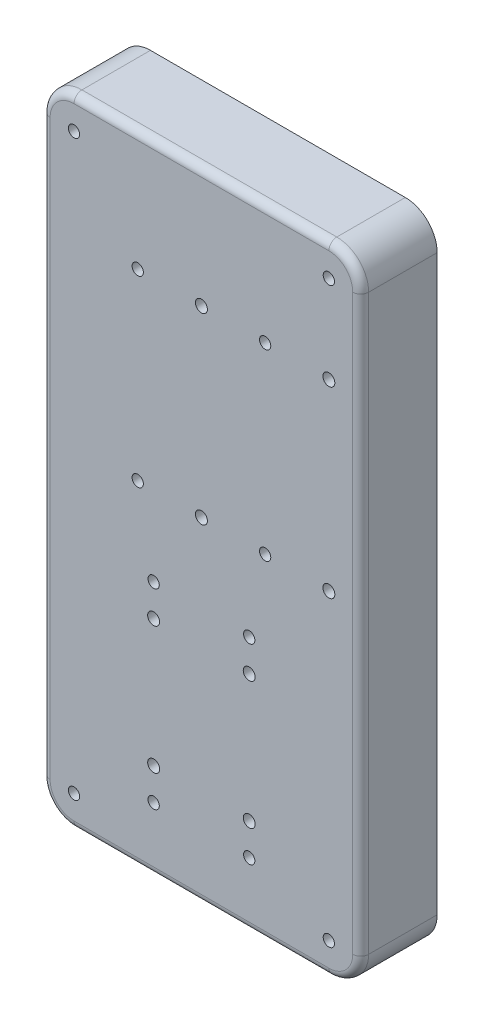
ISO-10303-21;
HEADER;
FILE_DESCRIPTION(('STEP AP214'),'2;1');
FILE_NAME('part.step','',(''),(''),'','','');
FILE_SCHEMA(('AUTOMOTIVE_DESIGN { 1 0 10303 214 1 1 1 1 }'));
ENDSEC;
DATA;
#1=APPLICATION_CONTEXT('core data for automotive mechanical design processes');
#2=APPLICATION_PROTOCOL_DEFINITION('international standard','automotive_design',2000,#1);
#3=PRODUCT_CONTEXT('',#1,'mechanical');
#4=PRODUCT('Part','Part','',(#3));
#5=PRODUCT_RELATED_PRODUCT_CATEGORY('part','',(#4));
#6=PRODUCT_DEFINITION_FORMATION('','',#4);
#7=PRODUCT_DEFINITION_CONTEXT('part definition',#1,'design');
#8=PRODUCT_DEFINITION('design','',#6,#7);
#9=PRODUCT_DEFINITION_SHAPE('','',#8);
#10=(LENGTH_UNIT() NAMED_UNIT(*) SI_UNIT(.MILLI.,.METRE.));
#11=(NAMED_UNIT(*) PLANE_ANGLE_UNIT() SI_UNIT($,.RADIAN.));
#12=(NAMED_UNIT(*) SI_UNIT($,.STERADIAN.) SOLID_ANGLE_UNIT());
#13=UNCERTAINTY_MEASURE_WITH_UNIT(LENGTH_MEASURE(1.E-05),#10,'distance_accuracy_value','');
#14=(GEOMETRIC_REPRESENTATION_CONTEXT(3) GLOBAL_UNCERTAINTY_ASSIGNED_CONTEXT((#13)) GLOBAL_UNIT_ASSIGNED_CONTEXT((#10,
#11,#12)) REPRESENTATION_CONTEXT('',''));
#15=CARTESIAN_POINT('',(0.,0.,0.));
#16=DIRECTION('',(0.,0.,1.));
#17=DIRECTION('',(1.,0.,0.));
#18=AXIS2_PLACEMENT_3D('',#15,#16,#17);
#19=CARTESIAN_POINT('',(-63.5,127.,30.48));
#20=DIRECTION('',(1.,0.,0.));
#21=DIRECTION('',(0.,0.,-1.));
#22=AXIS2_PLACEMENT_3D('',#19,#20,#21);
#23=PLANE('',#22);
#24=DIRECTION('',(0.,0.,-1.));
#25=VECTOR('',#24,1.);
#26=CARTESIAN_POINT('',(-63.5,-114.3,30.48));
#27=LINE('',#26,#25);
#28=CARTESIAN_POINT('',(-63.5,-114.3,0.));
#29=VERTEX_POINT('',#28);
#30=CARTESIAN_POINT('',(-63.5,-114.3,27.305));
#31=VERTEX_POINT('',#30);
#32=EDGE_CURVE('E138',#29,#31,#27,.F.);
#33=ORIENTED_EDGE('',*,*,#32,.T.);
#34=DIRECTION('',(0.,-1.,0.));
#35=VECTOR('',#34,1.);
#36=CARTESIAN_POINT('',(-63.5,114.3,27.305));
#37=LINE('',#36,#35);
#38=CARTESIAN_POINT('',(-63.5,114.3,27.305));
#39=VERTEX_POINT('',#38);
#40=EDGE_CURVE('E134',#31,#39,#37,.F.);
#41=ORIENTED_EDGE('',*,*,#40,.T.);
#42=DIRECTION('',(0.,0.,-1.));
#43=VECTOR('',#42,1.);
#44=CARTESIAN_POINT('',(-63.5,114.3,30.48));
#45=LINE('',#44,#43);
#46=CARTESIAN_POINT('',(-63.5,114.3,0.));
#47=VERTEX_POINT('',#46);
#48=EDGE_CURVE('E127',#39,#47,#45,.T.);
#49=ORIENTED_EDGE('',*,*,#48,.T.);
#50=DIRECTION('',(0.,-1.,0.));
#51=VECTOR('',#50,1.);
#52=CARTESIAN_POINT('',(-63.5,127.,0.));
#53=LINE('',#52,#51);
#54=EDGE_CURVE('E131',#47,#29,#53,.T.);
#55=ORIENTED_EDGE('',*,*,#54,.T.);
#56=EDGE_LOOP('',(#33,#41,#49,#55));
#57=FACE_BOUND('',#56,.T.);
#58=ADVANCED_FACE('F36',(#57),#23,.F.);
#59=CARTESIAN_POINT('',(-63.5,-127.,30.48));
#60=DIRECTION('',(0.,1.,0.));
#61=DIRECTION('',(0.,0.,1.));
#62=AXIS2_PLACEMENT_3D('',#59,#60,#61);
#63=PLANE('',#62);
#64=DIRECTION('',(0.,0.,-1.));
#65=VECTOR('',#64,1.);
#66=CARTESIAN_POINT('',(50.8,-127.,30.48));
#67=LINE('',#66,#65);
#68=CARTESIAN_POINT('',(50.8,-127.,0.));
#69=VERTEX_POINT('',#68);
#70=CARTESIAN_POINT('',(50.8,-127.,27.305));
#71=VERTEX_POINT('',#70);
#72=EDGE_CURVE('E181',#69,#71,#67,.F.);
#73=ORIENTED_EDGE('',*,*,#72,.T.);
#74=DIRECTION('',(1.,0.,0.));
#75=VECTOR('',#74,1.);
#76=CARTESIAN_POINT('',(-50.8,-127.,27.305));
#77=LINE('',#76,#75);
#78=CARTESIAN_POINT('',(-50.8,-127.,27.305));
#79=VERTEX_POINT('',#78);
#80=EDGE_CURVE('E204',#71,#79,#77,.F.);
#81=ORIENTED_EDGE('',*,*,#80,.T.);
#82=DIRECTION('',(0.,0.,-1.));
#83=VECTOR('',#82,1.);
#84=CARTESIAN_POINT('',(-50.8,-127.,30.48));
#85=LINE('',#84,#83);
#86=CARTESIAN_POINT('',(-50.8,-127.,0.));
#87=VERTEX_POINT('',#86);
#88=EDGE_CURVE('E179',#79,#87,#85,.T.);
#89=ORIENTED_EDGE('',*,*,#88,.T.);
#90=DIRECTION('',(1.,0.,0.));
#91=VECTOR('',#90,1.);
#92=CARTESIAN_POINT('',(-63.5,-127.,0.));
#93=LINE('',#92,#91);
#94=EDGE_CURVE('E153',#87,#69,#93,.T.);
#95=ORIENTED_EDGE('',*,*,#94,.T.);
#96=EDGE_LOOP('',(#73,#81,#89,#95));
#97=FACE_BOUND('',#96,.T.);
#98=ADVANCED_FACE('F380',(#97),#63,.F.);
#99=CARTESIAN_POINT('',(63.5,127.,30.48));
#100=DIRECTION('',(-1.,0.,0.));
#101=DIRECTION('',(0.,-1.,0.));
#102=AXIS2_PLACEMENT_3D('',#99,#100,#101);
#103=PLANE('',#102);
#104=DIRECTION('',(0.,0.,-1.));
#105=VECTOR('',#104,1.);
#106=CARTESIAN_POINT('',(63.5,114.3,30.48));
#107=LINE('',#106,#105);
#108=CARTESIAN_POINT('',(63.5,114.3,0.));
#109=VERTEX_POINT('',#108);
#110=CARTESIAN_POINT('',(63.5,114.3,27.305));
#111=VERTEX_POINT('',#110);
#112=EDGE_CURVE('E177',#109,#111,#107,.F.);
#113=ORIENTED_EDGE('',*,*,#112,.T.);
#114=DIRECTION('',(0.,1.,0.));
#115=VECTOR('',#114,1.);
#116=CARTESIAN_POINT('',(63.5,-114.3,27.305));
#117=LINE('',#116,#115);
#118=CARTESIAN_POINT('',(63.5,-114.3,27.305));
#119=VERTEX_POINT('',#118);
#120=EDGE_CURVE('E11',#111,#119,#117,.F.);
#121=ORIENTED_EDGE('',*,*,#120,.T.);
#122=DIRECTION('',(0.,0.,-1.));
#123=VECTOR('',#122,1.);
#124=CARTESIAN_POINT('',(63.5,-114.3,30.48));
#125=LINE('',#124,#123);
#126=CARTESIAN_POINT('',(63.5,-114.3,0.));
#127=VERTEX_POINT('',#126);
#128=EDGE_CURVE('E175',#119,#127,#125,.T.);
#129=ORIENTED_EDGE('',*,*,#128,.T.);
#130=DIRECTION('',(0.,1.,0.));
#131=VECTOR('',#130,1.);
#132=CARTESIAN_POINT('',(63.5,127.,0.));
#133=LINE('',#132,#131);
#134=EDGE_CURVE('E157',#127,#109,#133,.T.);
#135=ORIENTED_EDGE('',*,*,#134,.T.);
#136=EDGE_LOOP('',(#113,#121,#129,#135));
#137=FACE_BOUND('',#136,.T.);
#138=ADVANCED_FACE('F385',(#137),#103,.F.);
#139=CARTESIAN_POINT('',(-63.5,127.,30.48));
#140=DIRECTION('',(0.,-1.,0.));
#141=DIRECTION('',(0.,0.,-1.));
#142=AXIS2_PLACEMENT_3D('',#139,#140,#141);
#143=PLANE('',#142);
#144=DIRECTION('',(0.,0.,-1.));
#145=VECTOR('',#144,1.);
#146=CARTESIAN_POINT('',(-50.8,127.,30.48));
#147=LINE('',#146,#145);
#148=CARTESIAN_POINT('',(-50.8,127.,0.));
#149=VERTEX_POINT('',#148);
#150=CARTESIAN_POINT('',(-50.8,127.,27.305));
#151=VERTEX_POINT('',#150);
#152=EDGE_CURVE('E143',#149,#151,#147,.F.);
#153=ORIENTED_EDGE('',*,*,#152,.T.);
#154=DIRECTION('',(-1.,0.,0.));
#155=VECTOR('',#154,1.);
#156=CARTESIAN_POINT('',(50.8,127.,27.305));
#157=LINE('',#156,#155);
#158=CARTESIAN_POINT('',(50.8,127.,27.305));
#159=VERTEX_POINT('',#158);
#160=EDGE_CURVE('E60',#151,#159,#157,.F.);
#161=ORIENTED_EDGE('',*,*,#160,.T.);
#162=DIRECTION('',(0.,0.,-1.));
#163=VECTOR('',#162,1.);
#164=CARTESIAN_POINT('',(50.8,127.,30.48));
#165=LINE('',#164,#163);
#166=CARTESIAN_POINT('',(50.8,127.,0.));
#167=VERTEX_POINT('',#166);
#168=EDGE_CURVE('E147',#159,#167,#165,.T.);
#169=ORIENTED_EDGE('',*,*,#168,.T.);
#170=DIRECTION('',(-1.,0.,0.));
#171=VECTOR('',#170,1.);
#172=CARTESIAN_POINT('',(-63.5,127.,0.));
#173=LINE('',#172,#171);
#174=EDGE_CURVE('E166',#167,#149,#173,.T.);
#175=ORIENTED_EDGE('',*,*,#174,.T.);
#176=EDGE_LOOP('',(#153,#161,#169,#175));
#177=FACE_BOUND('',#176,.T.);
#178=ADVANCED_FACE('F373',(#177),#143,.F.);
#179=CARTESIAN_POINT('',(-63.5,-127.,30.48));
#180=DIRECTION('',(0.,0.,1.));
#181=DIRECTION('',(1.,0.,0.));
#182=AXIS2_PLACEMENT_3D('',#179,#180,#181);
#183=PLANE('',#182);
#184=CARTESIAN_POINT('',(-50.8,114.3,30.48));
#185=DIRECTION('',(0.,0.,1.));
#186=DIRECTION('',(1.,0.,0.));
#187=AXIS2_PLACEMENT_3D('',#184,#185,#186);
#188=CIRCLE('',#187,2.24789999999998);
#189=CARTESIAN_POINT('',(-48.5521,114.3,30.48));
#190=VERTEX_POINT('',#189);
#191=EDGE_CURVE('E604',#190,#190,#188,.T.);
#192=ORIENTED_EDGE('',*,*,#191,.F.);
#193=EDGE_LOOP('',(#192));
#194=FACE_BOUND('',#193,.T.);
#195=CARTESIAN_POINT('',(50.8,114.3,30.48));
#196=DIRECTION('',(0.,0.,1.));
#197=DIRECTION('',(1.,0.,0.));
#198=AXIS2_PLACEMENT_3D('',#195,#196,#197);
#199=CIRCLE('',#198,2.24789999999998);
#200=CARTESIAN_POINT('',(53.0479,114.3,30.48));
#201=VERTEX_POINT('',#200);
#202=EDGE_CURVE('E606',#201,#201,#199,.T.);
#203=ORIENTED_EDGE('',*,*,#202,.F.);
#204=EDGE_LOOP('',(#203));
#205=FACE_BOUND('',#204,.T.);
#206=CARTESIAN_POINT('',(50.8,-114.3,30.48));
#207=DIRECTION('',(0.,0.,1.));
#208=DIRECTION('',(1.,0.,0.));
#209=AXIS2_PLACEMENT_3D('',#206,#207,#208);
#210=CIRCLE('',#209,2.24789999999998);
#211=CARTESIAN_POINT('',(53.0479,-114.3,30.48));
#212=VERTEX_POINT('',#211);
#213=EDGE_CURVE('E614',#212,#212,#210,.T.);
#214=ORIENTED_EDGE('',*,*,#213,.F.);
#215=EDGE_LOOP('',(#214));
#216=FACE_BOUND('',#215,.T.);
#217=CARTESIAN_POINT('',(-50.8,-114.3,30.48));
#218=DIRECTION('',(0.,0.,1.));
#219=DIRECTION('',(1.,0.,0.));
#220=AXIS2_PLACEMENT_3D('',#217,#218,#219);
#221=CIRCLE('',#220,2.24789999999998);
#222=CARTESIAN_POINT('',(-48.5521,-114.3,30.48));
#223=VERTEX_POINT('',#222);
#224=EDGE_CURVE('E620',#223,#223,#221,.T.);
#225=ORIENTED_EDGE('',*,*,#224,.F.);
#226=EDGE_LOOP('',(#225));
#227=FACE_BOUND('',#226,.T.);
#228=DIRECTION('',(1.,0.,0.));
#229=VECTOR('',#228,1.);
#230=CARTESIAN_POINT('',(50.8,-123.825,30.48));
#231=LINE('',#230,#229);
#232=CARTESIAN_POINT('',(-50.8,-123.825,30.48));
#233=VERTEX_POINT('',#232);
#234=CARTESIAN_POINT('',(50.8,-123.825,30.48));
#235=VERTEX_POINT('',#234);
#236=EDGE_CURVE('E196',#233,#235,#231,.T.);
#237=ORIENTED_EDGE('',*,*,#236,.T.);
#238=CARTESIAN_POINT('',(50.8,-114.3,30.48));
#239=DIRECTION('',(0.,0.,1.));
#240=DIRECTION('',(1.,0.,0.));
#241=AXIS2_PLACEMENT_3D('',#238,#239,#240);
#242=CIRCLE('',#241,9.525);
#243=CARTESIAN_POINT('',(60.325,-114.3,30.48));
#244=VERTEX_POINT('',#243);
#245=EDGE_CURVE('E198',#235,#244,#242,.T.);
#246=ORIENTED_EDGE('',*,*,#245,.T.);
#247=DIRECTION('',(0.,1.,0.));
#248=VECTOR('',#247,1.);
#249=CARTESIAN_POINT('',(60.325,114.3,30.48));
#250=LINE('',#249,#248);
#251=CARTESIAN_POINT('',(60.325,114.3,30.48));
#252=VERTEX_POINT('',#251);
#253=EDGE_CURVE('E184',#244,#252,#250,.T.);
#254=ORIENTED_EDGE('',*,*,#253,.T.);
#255=CARTESIAN_POINT('',(50.8,114.3,30.48));
#256=DIRECTION('',(0.,0.,1.));
#257=DIRECTION('',(1.,0.,0.));
#258=AXIS2_PLACEMENT_3D('',#255,#256,#257);
#259=CIRCLE('',#258,9.525);
#260=CARTESIAN_POINT('',(50.8,123.825,30.48));
#261=VERTEX_POINT('',#260);
#262=EDGE_CURVE('E186',#252,#261,#259,.T.);
#263=ORIENTED_EDGE('',*,*,#262,.T.);
#264=DIRECTION('',(-1.,0.,0.));
#265=VECTOR('',#264,1.);
#266=CARTESIAN_POINT('',(-50.8,123.825,30.48));
#267=LINE('',#266,#265);
#268=CARTESIAN_POINT('',(-50.8,123.825,30.48));
#269=VERTEX_POINT('',#268);
#270=EDGE_CURVE('E188',#261,#269,#267,.T.);
#271=ORIENTED_EDGE('',*,*,#270,.T.);
#272=CARTESIAN_POINT('',(-50.8,114.3,30.48));
#273=DIRECTION('',(0.,0.,1.));
#274=DIRECTION('',(1.,0.,0.));
#275=AXIS2_PLACEMENT_3D('',#272,#273,#274);
#276=CIRCLE('',#275,9.525);
#277=CARTESIAN_POINT('',(-60.325,114.3,30.48));
#278=VERTEX_POINT('',#277);
#279=EDGE_CURVE('E190',#269,#278,#276,.T.);
#280=ORIENTED_EDGE('',*,*,#279,.T.);
#281=DIRECTION('',(0.,-1.,0.));
#282=VECTOR('',#281,1.);
#283=CARTESIAN_POINT('',(-60.325,-114.3,30.48));
#284=LINE('',#283,#282);
#285=CARTESIAN_POINT('',(-60.325,-114.3,30.48));
#286=VERTEX_POINT('',#285);
#287=EDGE_CURVE('E192',#278,#286,#284,.T.);
#288=ORIENTED_EDGE('',*,*,#287,.T.);
#289=CARTESIAN_POINT('',(-50.8,-114.3,30.48));
#290=DIRECTION('',(0.,0.,1.));
#291=DIRECTION('',(1.,0.,0.));
#292=AXIS2_PLACEMENT_3D('',#289,#290,#291);
#293=CIRCLE('',#292,9.525);
#294=EDGE_CURVE('E194',#286,#233,#293,.T.);
#295=ORIENTED_EDGE('',*,*,#294,.T.);
#296=EDGE_LOOP('',(#237,#246,#254,#263,#271,#280,#288,#295));
#297=FACE_BOUND('',#296,.T.);
#298=CARTESIAN_POINT('',(0.,79.375,30.48));
#299=DIRECTION('',(0.,0.,-1.));
#300=DIRECTION('',(-1.,0.,0.));
#301=AXIS2_PLACEMENT_3D('',#298,#299,#300);
#302=CIRCLE('',#301,2.38125);
#303=CARTESIAN_POINT('',(-2.38124999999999,79.375,30.48));
#304=VERTEX_POINT('',#303);
#305=EDGE_CURVE('E240',#304,#304,#302,.T.);
#306=ORIENTED_EDGE('',*,*,#305,.T.);
#307=EDGE_LOOP('',(#306));
#308=FACE_BOUND('',#307,.T.);
#309=CARTESIAN_POINT('',(50.8,79.375,30.48));
#310=DIRECTION('',(0.,0.,-1.));
#311=DIRECTION('',(-1.,0.,0.));
#312=AXIS2_PLACEMENT_3D('',#309,#310,#311);
#313=CIRCLE('',#312,2.38125);
#314=CARTESIAN_POINT('',(48.41875,79.375,30.48));
#315=VERTEX_POINT('',#314);
#316=EDGE_CURVE('E249',#315,#315,#313,.T.);
#317=ORIENTED_EDGE('',*,*,#316,.T.);
#318=EDGE_LOOP('',(#317));
#319=FACE_BOUND('',#318,.T.);
#320=CARTESIAN_POINT('',(50.8,6.35,30.48));
#321=DIRECTION('',(0.,0.,-1.));
#322=DIRECTION('',(-1.,0.,0.));
#323=AXIS2_PLACEMENT_3D('',#320,#321,#322);
#324=CIRCLE('',#323,2.38125);
#325=CARTESIAN_POINT('',(48.41875,6.35,30.48));
#326=VERTEX_POINT('',#325);
#327=EDGE_CURVE('E255',#326,#326,#324,.T.);
#328=ORIENTED_EDGE('',*,*,#327,.T.);
#329=EDGE_LOOP('',(#328));
#330=FACE_BOUND('',#329,.T.);
#331=CARTESIAN_POINT('',(0.,6.35,30.48));
#332=DIRECTION('',(0.,0.,-1.));
#333=DIRECTION('',(-1.,0.,0.));
#334=AXIS2_PLACEMENT_3D('',#331,#332,#333);
#335=CIRCLE('',#334,2.38125);
#336=CARTESIAN_POINT('',(-2.38124999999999,6.35,30.48));
#337=VERTEX_POINT('',#336);
#338=EDGE_CURVE('E261',#337,#337,#335,.T.);
#339=ORIENTED_EDGE('',*,*,#338,.T.);
#340=EDGE_LOOP('',(#339));
#341=FACE_BOUND('',#340,.T.);
#342=CARTESIAN_POINT('',(19.05,-88.9,30.48));
#343=DIRECTION('',(0.,0.,-1.));
#344=DIRECTION('',(-1.,0.,0.));
#345=AXIS2_PLACEMENT_3D('',#342,#343,#344);
#346=CIRCLE('',#345,2.38125);
#347=CARTESIAN_POINT('',(16.66875,-88.9,30.48));
#348=VERTEX_POINT('',#347);
#349=EDGE_CURVE('E267',#348,#348,#346,.T.);
#350=ORIENTED_EDGE('',*,*,#349,.T.);
#351=EDGE_LOOP('',(#350));
#352=FACE_BOUND('',#351,.T.);
#353=CARTESIAN_POINT('',(19.05,-38.1,30.48));
#354=DIRECTION('',(0.,0.,-1.));
#355=DIRECTION('',(-1.,0.,0.));
#356=AXIS2_PLACEMENT_3D('',#353,#354,#355);
#357=CIRCLE('',#356,2.38125);
#358=CARTESIAN_POINT('',(16.66875,-38.1,30.48));
#359=VERTEX_POINT('',#358);
#360=EDGE_CURVE('E273',#359,#359,#357,.T.);
#361=ORIENTED_EDGE('',*,*,#360,.T.);
#362=EDGE_LOOP('',(#361));
#363=FACE_BOUND('',#362,.T.);
#364=CARTESIAN_POINT('',(-19.05,-38.1,30.48));
#365=DIRECTION('',(0.,0.,-1.));
#366=DIRECTION('',(-1.,0.,0.));
#367=AXIS2_PLACEMENT_3D('',#364,#365,#366);
#368=CIRCLE('',#367,2.38125);
#369=CARTESIAN_POINT('',(-21.43125,-38.1,30.48));
#370=VERTEX_POINT('',#369);
#371=EDGE_CURVE('E279',#370,#370,#368,.T.);
#372=ORIENTED_EDGE('',*,*,#371,.T.);
#373=EDGE_LOOP('',(#372));
#374=FACE_BOUND('',#373,.T.);
#375=CARTESIAN_POINT('',(-19.05,-88.9,30.48));
#376=DIRECTION('',(0.,0.,-1.));
#377=DIRECTION('',(-1.,0.,0.));
#378=AXIS2_PLACEMENT_3D('',#375,#376,#377);
#379=CIRCLE('',#378,2.38125);
#380=CARTESIAN_POINT('',(-21.43125,-88.9,30.48));
#381=VERTEX_POINT('',#380);
#382=EDGE_CURVE('E285',#381,#381,#379,.T.);
#383=ORIENTED_EDGE('',*,*,#382,.T.);
#384=EDGE_LOOP('',(#383));
#385=FACE_BOUND('',#384,.T.);
#386=CARTESIAN_POINT('',(-25.4,79.375,30.48));
#387=DIRECTION('',(0.,0.,-1.));
#388=DIRECTION('',(-1.,0.,0.));
#389=AXIS2_PLACEMENT_3D('',#386,#387,#388);
#390=CIRCLE('',#389,2.24789999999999);
#391=CARTESIAN_POINT('',(-27.6479,79.375,30.48));
#392=VERTEX_POINT('',#391);
#393=EDGE_CURVE('E288',#392,#392,#390,.T.);
#394=ORIENTED_EDGE('',*,*,#393,.T.);
#395=EDGE_LOOP('',(#394));
#396=FACE_BOUND('',#395,.T.);
#397=CARTESIAN_POINT('',(25.4,79.375,30.48));
#398=DIRECTION('',(0.,0.,-1.));
#399=DIRECTION('',(-1.,0.,0.));
#400=AXIS2_PLACEMENT_3D('',#397,#398,#399);
#401=CIRCLE('',#400,2.24789999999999);
#402=CARTESIAN_POINT('',(23.1521,79.375,30.48));
#403=VERTEX_POINT('',#402);
#404=EDGE_CURVE('E299',#403,#403,#401,.T.);
#405=ORIENTED_EDGE('',*,*,#404,.T.);
#406=EDGE_LOOP('',(#405));
#407=FACE_BOUND('',#406,.T.);
#408=CARTESIAN_POINT('',(-25.4,6.35000000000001,30.48));
#409=DIRECTION('',(0.,0.,-1.));
#410=DIRECTION('',(-1.,0.,0.));
#411=AXIS2_PLACEMENT_3D('',#408,#409,#410);
#412=CIRCLE('',#411,2.24789999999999);
#413=CARTESIAN_POINT('',(-27.6479,6.35000000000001,30.48));
#414=VERTEX_POINT('',#413);
#415=EDGE_CURVE('E308',#414,#414,#412,.T.);
#416=ORIENTED_EDGE('',*,*,#415,.T.);
#417=EDGE_LOOP('',(#416));
#418=FACE_BOUND('',#417,.T.);
#419=CARTESIAN_POINT('',(25.4,6.35,30.48));
#420=DIRECTION('',(0.,0.,-1.));
#421=DIRECTION('',(-1.,0.,0.));
#422=AXIS2_PLACEMENT_3D('',#419,#420,#421);
#423=CIRCLE('',#422,2.24789999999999);
#424=CARTESIAN_POINT('',(23.1521,6.35,30.48));
#425=VERTEX_POINT('',#424);
#426=EDGE_CURVE('E317',#425,#425,#423,.T.);
#427=ORIENTED_EDGE('',*,*,#426,.T.);
#428=EDGE_LOOP('',(#427));
#429=FACE_BOUND('',#428,.T.);
#430=CARTESIAN_POINT('',(19.05,-25.4,30.48));
#431=DIRECTION('',(0.,0.,-1.));
#432=DIRECTION('',(-1.,0.,0.));
#433=AXIS2_PLACEMENT_3D('',#430,#431,#432);
#434=CIRCLE('',#433,2.24789999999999);
#435=CARTESIAN_POINT('',(16.8021,-25.4,30.48));
#436=VERTEX_POINT('',#435);
#437=EDGE_CURVE('E326',#436,#436,#434,.T.);
#438=ORIENTED_EDGE('',*,*,#437,.T.);
#439=EDGE_LOOP('',(#438));
#440=FACE_BOUND('',#439,.T.);
#441=CARTESIAN_POINT('',(19.05,-101.6,30.48));
#442=DIRECTION('',(0.,0.,-1.));
#443=DIRECTION('',(-1.,0.,0.));
#444=AXIS2_PLACEMENT_3D('',#441,#442,#443);
#445=CIRCLE('',#444,2.24789999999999);
#446=CARTESIAN_POINT('',(16.8021,-101.6,30.48));
#447=VERTEX_POINT('',#446);
#448=EDGE_CURVE('E335',#447,#447,#445,.T.);
#449=ORIENTED_EDGE('',*,*,#448,.T.);
#450=EDGE_LOOP('',(#449));
#451=FACE_BOUND('',#450,.T.);
#452=CARTESIAN_POINT('',(-19.05,-101.6,30.48));
#453=DIRECTION('',(0.,0.,-1.));
#454=DIRECTION('',(-1.,0.,0.));
#455=AXIS2_PLACEMENT_3D('',#452,#453,#454);
#456=CIRCLE('',#455,2.24789999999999);
#457=CARTESIAN_POINT('',(-21.2979,-101.6,30.48));
#458=VERTEX_POINT('',#457);
#459=EDGE_CURVE('E344',#458,#458,#456,.T.);
#460=ORIENTED_EDGE('',*,*,#459,.T.);
#461=EDGE_LOOP('',(#460));
#462=FACE_BOUND('',#461,.T.);
#463=CARTESIAN_POINT('',(-19.05,-25.4,30.48));
#464=DIRECTION('',(0.,0.,-1.));
#465=DIRECTION('',(-1.,0.,0.));
#466=AXIS2_PLACEMENT_3D('',#463,#464,#465);
#467=CIRCLE('',#466,2.24789999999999);
#468=CARTESIAN_POINT('',(-21.2979,-25.4,30.48));
#469=VERTEX_POINT('',#468);
#470=EDGE_CURVE('E353',#469,#469,#467,.T.);
#471=ORIENTED_EDGE('',*,*,#470,.T.);
#472=EDGE_LOOP('',(#471));
#473=FACE_BOUND('',#472,.T.);
#474=ADVANCED_FACE('F367',(#194,#205,#216,#227,#297,#308,#319,#330,#341,#352,#363,#374,#385,
#396,#407,#418,#429,#440,#451,#462,#473),#183,.T.);
#475=CARTESIAN_POINT('',(-63.5,-127.,0.));
#476=DIRECTION('',(0.,0.,1.));
#477=DIRECTION('',(1.,0.,0.));
#478=AXIS2_PLACEMENT_3D('',#475,#476,#477);
#479=PLANE('',#478);
#480=CARTESIAN_POINT('',(-50.8,114.3,0.));
#481=DIRECTION('',(0.,0.,1.));
#482=DIRECTION('',(1.,0.,0.));
#483=AXIS2_PLACEMENT_3D('',#480,#481,#482);
#484=CIRCLE('',#483,2.2479);
#485=CARTESIAN_POINT('',(-48.5521,114.3,0.));
#486=VERTEX_POINT('',#485);
#487=EDGE_CURVE('E601',#486,#486,#484,.T.);
#488=ORIENTED_EDGE('',*,*,#487,.T.);
#489=EDGE_LOOP('',(#488));
#490=FACE_BOUND('',#489,.T.);
#491=CARTESIAN_POINT('',(50.8,114.3,0.));
#492=DIRECTION('',(0.,0.,1.));
#493=DIRECTION('',(1.,0.,0.));
#494=AXIS2_PLACEMENT_3D('',#491,#492,#493);
#495=CIRCLE('',#494,2.2479);
#496=CARTESIAN_POINT('',(53.0479,114.3,0.));
#497=VERTEX_POINT('',#496);
#498=EDGE_CURVE('E611',#497,#497,#495,.T.);
#499=ORIENTED_EDGE('',*,*,#498,.T.);
#500=EDGE_LOOP('',(#499));
#501=FACE_BOUND('',#500,.T.);
#502=CARTESIAN_POINT('',(50.8,-114.3,0.));
#503=DIRECTION('',(0.,0.,1.));
#504=DIRECTION('',(1.,0.,0.));
#505=AXIS2_PLACEMENT_3D('',#502,#503,#504);
#506=CIRCLE('',#505,2.2479);
#507=CARTESIAN_POINT('',(53.0479,-114.3,0.));
#508=VERTEX_POINT('',#507);
#509=EDGE_CURVE('E617',#508,#508,#506,.T.);
#510=ORIENTED_EDGE('',*,*,#509,.T.);
#511=EDGE_LOOP('',(#510));
#512=FACE_BOUND('',#511,.T.);
#513=CARTESIAN_POINT('',(-50.8,-114.3,0.));
#514=DIRECTION('',(0.,0.,1.));
#515=DIRECTION('',(1.,0.,0.));
#516=AXIS2_PLACEMENT_3D('',#513,#514,#515);
#517=CIRCLE('',#516,2.2479);
#518=CARTESIAN_POINT('',(-48.5521,-114.3,0.));
#519=VERTEX_POINT('',#518);
#520=EDGE_CURVE('E216',#519,#519,#517,.T.);
#521=ORIENTED_EDGE('',*,*,#520,.T.);
#522=EDGE_LOOP('',(#521));
#523=FACE_BOUND('',#522,.T.);
#524=CARTESIAN_POINT('',(0.,79.375,0.));
#525=DIRECTION('',(0.,0.,-1.));
#526=DIRECTION('',(-1.,0.,0.));
#527=AXIS2_PLACEMENT_3D('',#524,#525,#526);
#528=CIRCLE('',#527,2.38125);
#529=CARTESIAN_POINT('',(-2.38124999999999,79.375,0.));
#530=VERTEX_POINT('',#529);
#531=EDGE_CURVE('E235',#530,#530,#528,.T.);
#532=ORIENTED_EDGE('',*,*,#531,.F.);
#533=EDGE_LOOP('',(#532));
#534=FACE_BOUND('',#533,.T.);
#535=CARTESIAN_POINT('',(50.8,79.375,0.));
#536=DIRECTION('',(0.,0.,-1.));
#537=DIRECTION('',(-1.,0.,0.));
#538=AXIS2_PLACEMENT_3D('',#535,#536,#537);
#539=CIRCLE('',#538,2.38125);
#540=CARTESIAN_POINT('',(48.41875,79.375,0.));
#541=VERTEX_POINT('',#540);
#542=EDGE_CURVE('E245',#541,#541,#539,.T.);
#543=ORIENTED_EDGE('',*,*,#542,.F.);
#544=EDGE_LOOP('',(#543));
#545=FACE_BOUND('',#544,.T.);
#546=CARTESIAN_POINT('',(50.8,6.35,0.));
#547=DIRECTION('',(0.,0.,-1.));
#548=DIRECTION('',(-1.,0.,0.));
#549=AXIS2_PLACEMENT_3D('',#546,#547,#548);
#550=CIRCLE('',#549,2.38125);
#551=CARTESIAN_POINT('',(48.41875,6.35,0.));
#552=VERTEX_POINT('',#551);
#553=EDGE_CURVE('E252',#552,#552,#550,.T.);
#554=ORIENTED_EDGE('',*,*,#553,.F.);
#555=EDGE_LOOP('',(#554));
#556=FACE_BOUND('',#555,.T.);
#557=CARTESIAN_POINT('',(0.,6.35,0.));
#558=DIRECTION('',(0.,0.,-1.));
#559=DIRECTION('',(-1.,0.,0.));
#560=AXIS2_PLACEMENT_3D('',#557,#558,#559);
#561=CIRCLE('',#560,2.38125);
#562=CARTESIAN_POINT('',(-2.38124999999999,6.35,0.));
#563=VERTEX_POINT('',#562);
#564=EDGE_CURVE('E258',#563,#563,#561,.T.);
#565=ORIENTED_EDGE('',*,*,#564,.F.);
#566=EDGE_LOOP('',(#565));
#567=FACE_BOUND('',#566,.T.);
#568=CARTESIAN_POINT('',(19.05,-88.9,0.));
#569=DIRECTION('',(0.,0.,-1.));
#570=DIRECTION('',(-1.,0.,0.));
#571=AXIS2_PLACEMENT_3D('',#568,#569,#570);
#572=CIRCLE('',#571,2.38125);
#573=CARTESIAN_POINT('',(16.66875,-88.9,0.));
#574=VERTEX_POINT('',#573);
#575=EDGE_CURVE('E264',#574,#574,#572,.T.);
#576=ORIENTED_EDGE('',*,*,#575,.F.);
#577=EDGE_LOOP('',(#576));
#578=FACE_BOUND('',#577,.T.);
#579=CARTESIAN_POINT('',(19.05,-38.1,0.));
#580=DIRECTION('',(0.,0.,-1.));
#581=DIRECTION('',(-1.,0.,0.));
#582=AXIS2_PLACEMENT_3D('',#579,#580,#581);
#583=CIRCLE('',#582,2.38125);
#584=CARTESIAN_POINT('',(16.66875,-38.1,0.));
#585=VERTEX_POINT('',#584);
#586=EDGE_CURVE('E270',#585,#585,#583,.T.);
#587=ORIENTED_EDGE('',*,*,#586,.F.);
#588=EDGE_LOOP('',(#587));
#589=FACE_BOUND('',#588,.T.);
#590=CARTESIAN_POINT('',(-19.05,-38.1,0.));
#591=DIRECTION('',(0.,0.,-1.));
#592=DIRECTION('',(-1.,0.,0.));
#593=AXIS2_PLACEMENT_3D('',#590,#591,#592);
#594=CIRCLE('',#593,2.38125);
#595=CARTESIAN_POINT('',(-21.43125,-38.1,0.));
#596=VERTEX_POINT('',#595);
#597=EDGE_CURVE('E276',#596,#596,#594,.T.);
#598=ORIENTED_EDGE('',*,*,#597,.F.);
#599=EDGE_LOOP('',(#598));
#600=FACE_BOUND('',#599,.T.);
#601=CARTESIAN_POINT('',(-19.05,-88.9,0.));
#602=DIRECTION('',(0.,0.,-1.));
#603=DIRECTION('',(-1.,0.,0.));
#604=AXIS2_PLACEMENT_3D('',#601,#602,#603);
#605=CIRCLE('',#604,2.38125);
#606=CARTESIAN_POINT('',(-21.43125,-88.9,0.));
#607=VERTEX_POINT('',#606);
#608=EDGE_CURVE('E282',#607,#607,#605,.T.);
#609=ORIENTED_EDGE('',*,*,#608,.F.);
#610=EDGE_LOOP('',(#609));
#611=FACE_BOUND('',#610,.T.);
#612=CARTESIAN_POINT('',(-25.4,79.375,0.));
#613=DIRECTION('',(0.,0.,-1.));
#614=DIRECTION('',(-1.,0.,0.));
#615=AXIS2_PLACEMENT_3D('',#612,#613,#614);
#616=CIRCLE('',#615,4.8787939);
#617=CARTESIAN_POINT('',(-30.2787939,79.375,0.));
#618=VERTEX_POINT('',#617);
#619=EDGE_CURVE('E296',#618,#618,#616,.T.);
#620=ORIENTED_EDGE('',*,*,#619,.F.);
#621=EDGE_LOOP('',(#620));
#622=FACE_BOUND('',#621,.T.);
#623=CARTESIAN_POINT('',(25.4,79.375,0.));
#624=DIRECTION('',(0.,0.,-1.));
#625=DIRECTION('',(-1.,0.,0.));
#626=AXIS2_PLACEMENT_3D('',#623,#624,#625);
#627=CIRCLE('',#626,4.8787939);
#628=CARTESIAN_POINT('',(20.5212061,79.375,0.));
#629=VERTEX_POINT('',#628);
#630=EDGE_CURVE('E305',#629,#629,#627,.T.);
#631=ORIENTED_EDGE('',*,*,#630,.F.);
#632=EDGE_LOOP('',(#631));
#633=FACE_BOUND('',#632,.T.);
#634=CARTESIAN_POINT('',(-25.4,6.35000000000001,0.));
#635=DIRECTION('',(0.,0.,-1.));
#636=DIRECTION('',(-1.,0.,0.));
#637=AXIS2_PLACEMENT_3D('',#634,#635,#636);
#638=CIRCLE('',#637,4.8787939);
#639=CARTESIAN_POINT('',(-30.2787939,6.35000000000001,0.));
#640=VERTEX_POINT('',#639);
#641=EDGE_CURVE('E314',#640,#640,#638,.T.);
#642=ORIENTED_EDGE('',*,*,#641,.F.);
#643=EDGE_LOOP('',(#642));
#644=FACE_BOUND('',#643,.T.);
#645=CARTESIAN_POINT('',(25.4,6.35,0.));
#646=DIRECTION('',(0.,0.,-1.));
#647=DIRECTION('',(-1.,0.,0.));
#648=AXIS2_PLACEMENT_3D('',#645,#646,#647);
#649=CIRCLE('',#648,4.8787939);
#650=CARTESIAN_POINT('',(20.5212061,6.35,0.));
#651=VERTEX_POINT('',#650);
#652=EDGE_CURVE('E323',#651,#651,#649,.T.);
#653=ORIENTED_EDGE('',*,*,#652,.F.);
#654=EDGE_LOOP('',(#653));
#655=FACE_BOUND('',#654,.T.);
#656=CARTESIAN_POINT('',(19.05,-25.4,0.));
#657=DIRECTION('',(0.,0.,-1.));
#658=DIRECTION('',(-1.,0.,0.));
#659=AXIS2_PLACEMENT_3D('',#656,#657,#658);
#660=CIRCLE('',#659,4.8787939);
#661=CARTESIAN_POINT('',(14.1712061,-25.4,0.));
#662=VERTEX_POINT('',#661);
#663=EDGE_CURVE('E332',#662,#662,#660,.T.);
#664=ORIENTED_EDGE('',*,*,#663,.F.);
#665=EDGE_LOOP('',(#664));
#666=FACE_BOUND('',#665,.T.);
#667=CARTESIAN_POINT('',(19.05,-101.6,0.));
#668=DIRECTION('',(0.,0.,-1.));
#669=DIRECTION('',(-1.,0.,0.));
#670=AXIS2_PLACEMENT_3D('',#667,#668,#669);
#671=CIRCLE('',#670,4.8787939);
#672=CARTESIAN_POINT('',(14.1712061,-101.6,0.));
#673=VERTEX_POINT('',#672);
#674=EDGE_CURVE('E341',#673,#673,#671,.T.);
#675=ORIENTED_EDGE('',*,*,#674,.F.);
#676=EDGE_LOOP('',(#675));
#677=FACE_BOUND('',#676,.T.);
#678=CARTESIAN_POINT('',(-19.05,-101.6,0.));
#679=DIRECTION('',(0.,0.,-1.));
#680=DIRECTION('',(-1.,0.,0.));
#681=AXIS2_PLACEMENT_3D('',#678,#679,#680);
#682=CIRCLE('',#681,4.8787939);
#683=CARTESIAN_POINT('',(-23.9287939,-101.6,0.));
#684=VERTEX_POINT('',#683);
#685=EDGE_CURVE('E350',#684,#684,#682,.T.);
#686=ORIENTED_EDGE('',*,*,#685,.F.);
#687=EDGE_LOOP('',(#686));
#688=FACE_BOUND('',#687,.T.);
#689=CARTESIAN_POINT('',(-19.05,-25.4,0.));
#690=DIRECTION('',(0.,0.,-1.));
#691=DIRECTION('',(-1.,0.,0.));
#692=AXIS2_PLACEMENT_3D('',#689,#690,#691);
#693=CIRCLE('',#692,4.8787939);
#694=CARTESIAN_POINT('',(-23.9287939,-25.4,0.));
#695=VERTEX_POINT('',#694);
#696=EDGE_CURVE('E154',#695,#695,#693,.T.);
#697=ORIENTED_EDGE('',*,*,#696,.F.);
#698=EDGE_LOOP('',(#697));
#699=FACE_BOUND('',#698,.T.);
#700=ORIENTED_EDGE('',*,*,#54,.F.);
#701=CARTESIAN_POINT('',(-50.8,114.3,0.));
#702=DIRECTION('',(0.,0.,1.));
#703=DIRECTION('',(1.,0.,0.));
#704=AXIS2_PLACEMENT_3D('',#701,#702,#703);
#705=CIRCLE('',#704,12.7);
#706=EDGE_CURVE('E141',#47,#149,#705,.F.);
#707=ORIENTED_EDGE('',*,*,#706,.T.);
#708=ORIENTED_EDGE('',*,*,#174,.F.);
#709=CARTESIAN_POINT('',(50.8,114.3,0.));
#710=DIRECTION('',(0.,0.,1.));
#711=DIRECTION('',(1.,0.,0.));
#712=AXIS2_PLACEMENT_3D('',#709,#710,#711);
#713=CIRCLE('',#712,12.7);
#714=EDGE_CURVE('E148',#167,#109,#713,.F.);
#715=ORIENTED_EDGE('',*,*,#714,.T.);
#716=ORIENTED_EDGE('',*,*,#134,.F.);
#717=CARTESIAN_POINT('',(50.8,-114.3,0.));
#718=DIRECTION('',(0.,0.,1.));
#719=DIRECTION('',(1.,0.,0.));
#720=AXIS2_PLACEMENT_3D('',#717,#718,#719);
#721=CIRCLE('',#720,12.7);
#722=EDGE_CURVE('E170',#127,#69,#721,.F.);
#723=ORIENTED_EDGE('',*,*,#722,.T.);
#724=ORIENTED_EDGE('',*,*,#94,.F.);
#725=CARTESIAN_POINT('',(-50.8,-114.3,0.));
#726=DIRECTION('',(0.,0.,1.));
#727=DIRECTION('',(1.,0.,0.));
#728=AXIS2_PLACEMENT_3D('',#725,#726,#727);
#729=CIRCLE('',#728,12.7);
#730=EDGE_CURVE('E137',#87,#29,#729,.F.);
#731=ORIENTED_EDGE('',*,*,#730,.T.);
#732=EDGE_LOOP('',(#700,#707,#708,#715,#716,#723,#724,#731));
#733=FACE_BOUND('',#732,.T.);
#734=ADVANCED_FACE('F150',(#490,#501,#512,#523,#534,#545,#556,#567,#578,#589,#600,#611,#622,
#633,#644,#655,#666,#677,#688,#699,#733),#479,.F.);
#735=CARTESIAN_POINT('',(-19.05,-25.4,0.));
#736=DIRECTION('',(0.,0.,-1.));
#737=DIRECTION('',(-1.,0.,0.));
#738=AXIS2_PLACEMENT_3D('',#735,#736,#737);
#739=CONICAL_SURFACE('',#738,4.8787939,0.715584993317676);
#740=CARTESIAN_POINT('',(-19.05,-25.4,3.02649722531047));
#741=DIRECTION('',(0.,0.,-1.));
#742=DIRECTION('',(-1.,0.,0.));
#743=AXIS2_PLACEMENT_3D('',#740,#741,#742);
#744=CIRCLE('',#743,2.2479);
#745=CARTESIAN_POINT('',(-21.2979,-25.4,3.02649722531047));
#746=VERTEX_POINT('',#745);
#747=EDGE_CURVE('E160',#746,#746,#744,.T.);
#748=ORIENTED_EDGE('',*,*,#747,.F.);
#749=EDGE_LOOP('',(#748));
#750=FACE_BOUND('',#749,.T.);
#751=ORIENTED_EDGE('',*,*,#696,.T.);
#752=EDGE_LOOP('',(#751));
#753=FACE_BOUND('',#752,.T.);
#754=ADVANCED_FACE('F360',(#750,#753),#739,.F.);
#755=CARTESIAN_POINT('',(-19.05,-25.4,0.));
#756=DIRECTION('',(0.,0.,-1.));
#757=DIRECTION('',(-1.,0.,0.));
#758=AXIS2_PLACEMENT_3D('',#755,#756,#757);
#759=CYLINDRICAL_SURFACE('',#758,2.2479);
#760=ORIENTED_EDGE('',*,*,#470,.F.);
#761=EDGE_LOOP('',(#760));
#762=FACE_BOUND('',#761,.T.);
#763=ORIENTED_EDGE('',*,*,#747,.T.);
#764=EDGE_LOOP('',(#763));
#765=FACE_BOUND('',#764,.T.);
#766=ADVANCED_FACE('F358',(#762,#765),#759,.F.);
#767=CARTESIAN_POINT('',(-19.05,-101.6,0.));
#768=DIRECTION('',(0.,0.,-1.));
#769=DIRECTION('',(-1.,0.,0.));
#770=AXIS2_PLACEMENT_3D('',#767,#768,#769);
#771=CONICAL_SURFACE('',#770,4.8787939,0.715584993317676);
#772=CARTESIAN_POINT('',(-19.05,-101.6,3.02649722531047));
#773=DIRECTION('',(0.,0.,-1.));
#774=DIRECTION('',(-1.,0.,0.));
#775=AXIS2_PLACEMENT_3D('',#772,#773,#774);
#776=CIRCLE('',#775,2.2479);
#777=CARTESIAN_POINT('',(-21.2979,-101.6,3.02649722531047));
#778=VERTEX_POINT('',#777);
#779=EDGE_CURVE('E347',#778,#778,#776,.T.);
#780=ORIENTED_EDGE('',*,*,#779,.F.);
#781=EDGE_LOOP('',(#780));
#782=FACE_BOUND('',#781,.T.);
#783=ORIENTED_EDGE('',*,*,#685,.T.);
#784=EDGE_LOOP('',(#783));
#785=FACE_BOUND('',#784,.T.);
#786=ADVANCED_FACE('F492',(#782,#785),#771,.F.);
#787=CARTESIAN_POINT('',(-19.05,-101.6,0.));
#788=DIRECTION('',(0.,0.,-1.));
#789=DIRECTION('',(-1.,0.,0.));
#790=AXIS2_PLACEMENT_3D('',#787,#788,#789);
#791=CYLINDRICAL_SURFACE('',#790,2.2479);
#792=ORIENTED_EDGE('',*,*,#459,.F.);
#793=EDGE_LOOP('',(#792));
#794=FACE_BOUND('',#793,.T.);
#795=ORIENTED_EDGE('',*,*,#779,.T.);
#796=EDGE_LOOP('',(#795));
#797=FACE_BOUND('',#796,.T.);
#798=ADVANCED_FACE('F497',(#794,#797),#791,.F.);
#799=CARTESIAN_POINT('',(19.05,-101.6,0.));
#800=DIRECTION('',(0.,0.,-1.));
#801=DIRECTION('',(-1.,0.,0.));
#802=AXIS2_PLACEMENT_3D('',#799,#800,#801);
#803=CONICAL_SURFACE('',#802,4.8787939,0.715584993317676);
#804=CARTESIAN_POINT('',(19.05,-101.6,3.02649722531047));
#805=DIRECTION('',(0.,0.,-1.));
#806=DIRECTION('',(-1.,0.,0.));
#807=AXIS2_PLACEMENT_3D('',#804,#805,#806);
#808=CIRCLE('',#807,2.2479);
#809=CARTESIAN_POINT('',(16.8021,-101.6,3.02649722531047));
#810=VERTEX_POINT('',#809);
#811=EDGE_CURVE('E338',#810,#810,#808,.T.);
#812=ORIENTED_EDGE('',*,*,#811,.F.);
#813=EDGE_LOOP('',(#812));
#814=FACE_BOUND('',#813,.T.);
#815=ORIENTED_EDGE('',*,*,#674,.T.);
#816=EDGE_LOOP('',(#815));
#817=FACE_BOUND('',#816,.T.);
#818=ADVANCED_FACE('F503',(#814,#817),#803,.F.);
#819=CARTESIAN_POINT('',(19.05,-101.6,0.));
#820=DIRECTION('',(0.,0.,-1.));
#821=DIRECTION('',(-1.,0.,0.));
#822=AXIS2_PLACEMENT_3D('',#819,#820,#821);
#823=CYLINDRICAL_SURFACE('',#822,2.2479);
#824=ORIENTED_EDGE('',*,*,#448,.F.);
#825=EDGE_LOOP('',(#824));
#826=FACE_BOUND('',#825,.T.);
#827=ORIENTED_EDGE('',*,*,#811,.T.);
#828=EDGE_LOOP('',(#827));
#829=FACE_BOUND('',#828,.T.);
#830=ADVANCED_FACE('F507',(#826,#829),#823,.F.);
#831=CARTESIAN_POINT('',(19.05,-25.4,0.));
#832=DIRECTION('',(0.,0.,-1.));
#833=DIRECTION('',(-1.,0.,0.));
#834=AXIS2_PLACEMENT_3D('',#831,#832,#833);
#835=CONICAL_SURFACE('',#834,4.8787939,0.715584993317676);
#836=CARTESIAN_POINT('',(19.05,-25.4,3.02649722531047));
#837=DIRECTION('',(0.,0.,-1.));
#838=DIRECTION('',(-1.,0.,0.));
#839=AXIS2_PLACEMENT_3D('',#836,#837,#838);
#840=CIRCLE('',#839,2.2479);
#841=CARTESIAN_POINT('',(16.8021,-25.4,3.02649722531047));
#842=VERTEX_POINT('',#841);
#843=EDGE_CURVE('E329',#842,#842,#840,.T.);
#844=ORIENTED_EDGE('',*,*,#843,.F.);
#845=EDGE_LOOP('',(#844));
#846=FACE_BOUND('',#845,.T.);
#847=ORIENTED_EDGE('',*,*,#663,.T.);
#848=EDGE_LOOP('',(#847));
#849=FACE_BOUND('',#848,.T.);
#850=ADVANCED_FACE('F511',(#846,#849),#835,.F.);
#851=CARTESIAN_POINT('',(19.05,-25.4,0.));
#852=DIRECTION('',(0.,0.,-1.));
#853=DIRECTION('',(-1.,0.,0.));
#854=AXIS2_PLACEMENT_3D('',#851,#852,#853);
#855=CYLINDRICAL_SURFACE('',#854,2.2479);
#856=ORIENTED_EDGE('',*,*,#437,.F.);
#857=EDGE_LOOP('',(#856));
#858=FACE_BOUND('',#857,.T.);
#859=ORIENTED_EDGE('',*,*,#843,.T.);
#860=EDGE_LOOP('',(#859));
#861=FACE_BOUND('',#860,.T.);
#862=ADVANCED_FACE('F515',(#858,#861),#855,.F.);
#863=CARTESIAN_POINT('',(25.4,6.35,0.));
#864=DIRECTION('',(0.,0.,-1.));
#865=DIRECTION('',(-1.,0.,0.));
#866=AXIS2_PLACEMENT_3D('',#863,#864,#865);
#867=CONICAL_SURFACE('',#866,4.8787939,0.715584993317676);
#868=CARTESIAN_POINT('',(25.4,6.35,3.02649722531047));
#869=DIRECTION('',(0.,0.,-1.));
#870=DIRECTION('',(-1.,0.,0.));
#871=AXIS2_PLACEMENT_3D('',#868,#869,#870);
#872=CIRCLE('',#871,2.2479);
#873=CARTESIAN_POINT('',(23.1521,6.35,3.02649722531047));
#874=VERTEX_POINT('',#873);
#875=EDGE_CURVE('E320',#874,#874,#872,.T.);
#876=ORIENTED_EDGE('',*,*,#875,.F.);
#877=EDGE_LOOP('',(#876));
#878=FACE_BOUND('',#877,.T.);
#879=ORIENTED_EDGE('',*,*,#652,.T.);
#880=EDGE_LOOP('',(#879));
#881=FACE_BOUND('',#880,.T.);
#882=ADVANCED_FACE('F519',(#878,#881),#867,.F.);
#883=CARTESIAN_POINT('',(25.4,6.35,0.));
#884=DIRECTION('',(0.,0.,-1.));
#885=DIRECTION('',(-1.,0.,0.));
#886=AXIS2_PLACEMENT_3D('',#883,#884,#885);
#887=CYLINDRICAL_SURFACE('',#886,2.2479);
#888=ORIENTED_EDGE('',*,*,#426,.F.);
#889=EDGE_LOOP('',(#888));
#890=FACE_BOUND('',#889,.T.);
#891=ORIENTED_EDGE('',*,*,#875,.T.);
#892=EDGE_LOOP('',(#891));
#893=FACE_BOUND('',#892,.T.);
#894=ADVANCED_FACE('F523',(#890,#893),#887,.F.);
#895=CARTESIAN_POINT('',(-25.4,6.35000000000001,0.));
#896=DIRECTION('',(0.,0.,-1.));
#897=DIRECTION('',(-1.,0.,0.));
#898=AXIS2_PLACEMENT_3D('',#895,#896,#897);
#899=CONICAL_SURFACE('',#898,4.8787939,0.715584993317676);
#900=CARTESIAN_POINT('',(-25.4,6.35000000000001,3.02649722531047));
#901=DIRECTION('',(0.,0.,-1.));
#902=DIRECTION('',(-1.,0.,0.));
#903=AXIS2_PLACEMENT_3D('',#900,#901,#902);
#904=CIRCLE('',#903,2.2479);
#905=CARTESIAN_POINT('',(-27.6479,6.35000000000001,3.02649722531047));
#906=VERTEX_POINT('',#905);
#907=EDGE_CURVE('E311',#906,#906,#904,.T.);
#908=ORIENTED_EDGE('',*,*,#907,.F.);
#909=EDGE_LOOP('',(#908));
#910=FACE_BOUND('',#909,.T.);
#911=ORIENTED_EDGE('',*,*,#641,.T.);
#912=EDGE_LOOP('',(#911));
#913=FACE_BOUND('',#912,.T.);
#914=ADVANCED_FACE('F527',(#910,#913),#899,.F.);
#915=CARTESIAN_POINT('',(-25.4,6.35000000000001,0.));
#916=DIRECTION('',(0.,0.,-1.));
#917=DIRECTION('',(-1.,0.,0.));
#918=AXIS2_PLACEMENT_3D('',#915,#916,#917);
#919=CYLINDRICAL_SURFACE('',#918,2.2479);
#920=ORIENTED_EDGE('',*,*,#415,.F.);
#921=EDGE_LOOP('',(#920));
#922=FACE_BOUND('',#921,.T.);
#923=ORIENTED_EDGE('',*,*,#907,.T.);
#924=EDGE_LOOP('',(#923));
#925=FACE_BOUND('',#924,.T.);
#926=ADVANCED_FACE('F531',(#922,#925),#919,.F.);
#927=CARTESIAN_POINT('',(25.4,79.375,0.));
#928=DIRECTION('',(0.,0.,-1.));
#929=DIRECTION('',(-1.,0.,0.));
#930=AXIS2_PLACEMENT_3D('',#927,#928,#929);
#931=CONICAL_SURFACE('',#930,4.8787939,0.715584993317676);
#932=CARTESIAN_POINT('',(25.4,79.375,3.02649722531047));
#933=DIRECTION('',(0.,0.,-1.));
#934=DIRECTION('',(-1.,0.,0.));
#935=AXIS2_PLACEMENT_3D('',#932,#933,#934);
#936=CIRCLE('',#935,2.2479);
#937=CARTESIAN_POINT('',(23.1521,79.375,3.02649722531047));
#938=VERTEX_POINT('',#937);
#939=EDGE_CURVE('E302',#938,#938,#936,.T.);
#940=ORIENTED_EDGE('',*,*,#939,.F.);
#941=EDGE_LOOP('',(#940));
#942=FACE_BOUND('',#941,.T.);
#943=ORIENTED_EDGE('',*,*,#630,.T.);
#944=EDGE_LOOP('',(#943));
#945=FACE_BOUND('',#944,.T.);
#946=ADVANCED_FACE('F535',(#942,#945),#931,.F.);
#947=CARTESIAN_POINT('',(25.4,79.375,0.));
#948=DIRECTION('',(0.,0.,-1.));
#949=DIRECTION('',(-1.,0.,0.));
#950=AXIS2_PLACEMENT_3D('',#947,#948,#949);
#951=CYLINDRICAL_SURFACE('',#950,2.2479);
#952=ORIENTED_EDGE('',*,*,#404,.F.);
#953=EDGE_LOOP('',(#952));
#954=FACE_BOUND('',#953,.T.);
#955=ORIENTED_EDGE('',*,*,#939,.T.);
#956=EDGE_LOOP('',(#955));
#957=FACE_BOUND('',#956,.T.);
#958=ADVANCED_FACE('F539',(#954,#957),#951,.F.);
#959=CARTESIAN_POINT('',(-25.4,79.375,0.));
#960=DIRECTION('',(0.,0.,-1.));
#961=DIRECTION('',(-1.,0.,0.));
#962=AXIS2_PLACEMENT_3D('',#959,#960,#961);
#963=CONICAL_SURFACE('',#962,4.8787939,0.715584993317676);
#964=CARTESIAN_POINT('',(-25.4,79.375,3.02649722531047));
#965=DIRECTION('',(0.,0.,-1.));
#966=DIRECTION('',(-1.,0.,0.));
#967=AXIS2_PLACEMENT_3D('',#964,#965,#966);
#968=CIRCLE('',#967,2.2479);
#969=CARTESIAN_POINT('',(-27.6479,79.375,3.02649722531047));
#970=VERTEX_POINT('',#969);
#971=EDGE_CURVE('E293',#970,#970,#968,.T.);
#972=ORIENTED_EDGE('',*,*,#971,.F.);
#973=EDGE_LOOP('',(#972));
#974=FACE_BOUND('',#973,.T.);
#975=ORIENTED_EDGE('',*,*,#619,.T.);
#976=EDGE_LOOP('',(#975));
#977=FACE_BOUND('',#976,.T.);
#978=ADVANCED_FACE('F543',(#974,#977),#963,.F.);
#979=CARTESIAN_POINT('',(-25.4,79.375,0.));
#980=DIRECTION('',(0.,0.,-1.));
#981=DIRECTION('',(-1.,0.,0.));
#982=AXIS2_PLACEMENT_3D('',#979,#980,#981);
#983=CYLINDRICAL_SURFACE('',#982,2.2479);
#984=ORIENTED_EDGE('',*,*,#393,.F.);
#985=EDGE_LOOP('',(#984));
#986=FACE_BOUND('',#985,.T.);
#987=ORIENTED_EDGE('',*,*,#971,.T.);
#988=EDGE_LOOP('',(#987));
#989=FACE_BOUND('',#988,.T.);
#990=ADVANCED_FACE('F547',(#986,#989),#983,.F.);
#991=CARTESIAN_POINT('',(-19.05,-88.9,30.48));
#992=DIRECTION('',(0.,0.,-1.));
#993=DIRECTION('',(-1.,0.,0.));
#994=AXIS2_PLACEMENT_3D('',#991,#992,#993);
#995=CYLINDRICAL_SURFACE('',#994,2.38125);
#996=CARTESIAN_POINT('',(-21.43125,-88.9,30.48));
#997=CARTESIAN_POINT('',(-21.43125,-88.9,30.1625));
#998=CARTESIAN_POINT('',(-21.43125,-88.9,29.845));
#999=CARTESIAN_POINT('',(-21.43125,-88.9,29.21));
#1000=CARTESIAN_POINT('',(-21.43125,-88.9,28.8925));
#1001=CARTESIAN_POINT('',(-21.43125,-88.9,28.2575));
#1002=CARTESIAN_POINT('',(-21.43125,-88.9,27.94));
#1003=CARTESIAN_POINT('',(-21.43125,-88.9,27.305));
#1004=CARTESIAN_POINT('',(-21.43125,-88.9,26.9875));
#1005=CARTESIAN_POINT('',(-21.43125,-88.9,26.3525));
#1006=CARTESIAN_POINT('',(-21.43125,-88.9,26.035));
#1007=CARTESIAN_POINT('',(-21.43125,-88.9,25.4));
#1008=CARTESIAN_POINT('',(-21.43125,-88.9,25.0825));
#1009=CARTESIAN_POINT('',(-21.43125,-88.9,24.4475));
#1010=CARTESIAN_POINT('',(-21.43125,-88.9,24.13));
#1011=CARTESIAN_POINT('',(-21.43125,-88.9,23.495));
#1012=CARTESIAN_POINT('',(-21.43125,-88.9,23.1775));
#1013=CARTESIAN_POINT('',(-21.43125,-88.9,22.5425));
#1014=CARTESIAN_POINT('',(-21.43125,-88.9,22.225));
#1015=CARTESIAN_POINT('',(-21.43125,-88.9,21.59));
#1016=CARTESIAN_POINT('',(-21.43125,-88.9,21.2725));
#1017=CARTESIAN_POINT('',(-21.43125,-88.9,20.6375));
#1018=CARTESIAN_POINT('',(-21.43125,-88.9,20.32));
#1019=CARTESIAN_POINT('',(-21.43125,-88.9,19.685));
#1020=CARTESIAN_POINT('',(-21.43125,-88.9,19.3675));
#1021=CARTESIAN_POINT('',(-21.43125,-88.9,18.7325));
#1022=CARTESIAN_POINT('',(-21.43125,-88.9,18.415));
#1023=CARTESIAN_POINT('',(-21.43125,-88.9,17.78));
#1024=CARTESIAN_POINT('',(-21.43125,-88.9,17.4625));
#1025=CARTESIAN_POINT('',(-21.43125,-88.9,16.8275));
#1026=CARTESIAN_POINT('',(-21.43125,-88.9,16.51));
#1027=CARTESIAN_POINT('',(-21.43125,-88.9,15.875));
#1028=CARTESIAN_POINT('',(-21.43125,-88.9,15.5575));
#1029=CARTESIAN_POINT('',(-21.43125,-88.9,14.9225));
#1030=CARTESIAN_POINT('',(-21.43125,-88.9,14.605));
#1031=CARTESIAN_POINT('',(-21.43125,-88.9,13.97));
#1032=CARTESIAN_POINT('',(-21.43125,-88.9,13.6525));
#1033=CARTESIAN_POINT('',(-21.43125,-88.9,13.0175));
#1034=CARTESIAN_POINT('',(-21.43125,-88.9,12.7));
#1035=CARTESIAN_POINT('',(-21.43125,-88.9,12.065));
#1036=CARTESIAN_POINT('',(-21.43125,-88.9,11.7475));
#1037=CARTESIAN_POINT('',(-21.43125,-88.9,11.1125));
#1038=CARTESIAN_POINT('',(-21.43125,-88.9,10.795));
#1039=CARTESIAN_POINT('',(-21.43125,-88.9,10.16));
#1040=CARTESIAN_POINT('',(-21.43125,-88.9,9.8425));
#1041=CARTESIAN_POINT('',(-21.43125,-88.9,9.2075));
#1042=CARTESIAN_POINT('',(-21.43125,-88.9,8.89));
#1043=CARTESIAN_POINT('',(-21.43125,-88.9,8.255));
#1044=CARTESIAN_POINT('',(-21.43125,-88.9,7.9375));
#1045=CARTESIAN_POINT('',(-21.43125,-88.9,7.3025));
#1046=CARTESIAN_POINT('',(-21.43125,-88.9,6.985));
#1047=CARTESIAN_POINT('',(-21.43125,-88.9,6.35));
#1048=CARTESIAN_POINT('',(-21.43125,-88.9,6.0325));
#1049=CARTESIAN_POINT('',(-21.43125,-88.9,5.3975));
#1050=CARTESIAN_POINT('',(-21.43125,-88.9,5.08));
#1051=CARTESIAN_POINT('',(-21.43125,-88.9,4.445));
#1052=CARTESIAN_POINT('',(-21.43125,-88.9,4.1275));
#1053=CARTESIAN_POINT('',(-21.43125,-88.9,3.4925));
#1054=CARTESIAN_POINT('',(-21.43125,-88.9,3.175));
#1055=CARTESIAN_POINT('',(-21.43125,-88.9,2.54));
#1056=CARTESIAN_POINT('',(-21.43125,-88.9,2.2225));
#1057=CARTESIAN_POINT('',(-21.43125,-88.9,1.5875));
#1058=CARTESIAN_POINT('',(-21.43125,-88.9,1.27));
#1059=CARTESIAN_POINT('',(-21.43125,-88.9,0.634999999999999));
#1060=CARTESIAN_POINT('',(-21.43125,-88.9,0.3175));
#1061=CARTESIAN_POINT('',(-21.43125,-88.9,0.));
#1062=B_SPLINE_CURVE_WITH_KNOTS('',3,(#996,#997,#998,#999,#1000,#1001,#1002,#1003,#1004,#1005,
#1006,#1007,#1008,#1009,#1010,#1011,#1012,#1013,#1014,#1015,#1016,#1017,#1018,#1019,#1020,#1021,
#1022,#1023,#1024,#1025,#1026,#1027,#1028,#1029,#1030,#1031,#1032,#1033,#1034,#1035,#1036,#1037,
#1038,#1039,#1040,#1041,#1042,#1043,#1044,#1045,#1046,#1047,#1048,#1049,#1050,#1051,#1052,#1053,
#1054,#1055,#1056,#1057,#1058,#1059,#1060,#1061),.UNSPECIFIED.,.F.,.F.,(4,2,2,2,2,2,2,2,2,2,2,2,
2,2,2,2,2,2,2,2,2,2,2,2,2,2,2,2,2,2,2,2,4),(0.,0.952499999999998,1.905,2.8575,3.81,4.7625,5.715,
6.6675,7.62,8.5725,9.525,10.4775,11.43,12.3825,13.335,14.2875,15.24,16.1925,17.145,18.0975,
19.05,20.0025,20.955,21.9075,22.86,23.8125,24.765,25.7175,26.67,27.6225,28.575,29.5275,30.48),.UNSPECIFIED.);
#1063=EDGE_CURVE('BSEAM551',#381,#607,#1062,.T.);
#1064=ORIENTED_EDGE('',*,*,#382,.F.);
#1065=ORIENTED_EDGE('',*,*,#608,.T.);
#1066=ORIENTED_EDGE('',*,*,#1063,.T.);
#1067=ORIENTED_EDGE('',*,*,#1063,.F.);
#1068=EDGE_LOOP('',(#1064,#1066,#1065,#1067));
#1069=FACE_BOUND('',#1068,.T.);
#1070=ADVANCED_FACE('F551',(#1069),#995,.F.);
#1071=CARTESIAN_POINT('',(-19.05,-38.1,30.48));
#1072=DIRECTION('',(0.,0.,-1.));
#1073=DIRECTION('',(-1.,0.,0.));
#1074=AXIS2_PLACEMENT_3D('',#1071,#1072,#1073);
#1075=CYLINDRICAL_SURFACE('',#1074,2.38125);
#1076=CARTESIAN_POINT('',(-21.43125,-38.1,30.48));
#1077=CARTESIAN_POINT('',(-21.43125,-38.1,30.1625));
#1078=CARTESIAN_POINT('',(-21.43125,-38.1,29.845));
#1079=CARTESIAN_POINT('',(-21.43125,-38.1,29.21));
#1080=CARTESIAN_POINT('',(-21.43125,-38.1,28.8925));
#1081=CARTESIAN_POINT('',(-21.43125,-38.1,28.2575));
#1082=CARTESIAN_POINT('',(-21.43125,-38.1,27.94));
#1083=CARTESIAN_POINT('',(-21.43125,-38.1,27.305));
#1084=CARTESIAN_POINT('',(-21.43125,-38.1,26.9875));
#1085=CARTESIAN_POINT('',(-21.43125,-38.1,26.3525));
#1086=CARTESIAN_POINT('',(-21.43125,-38.1,26.035));
#1087=CARTESIAN_POINT('',(-21.43125,-38.1,25.4));
#1088=CARTESIAN_POINT('',(-21.43125,-38.1,25.0825));
#1089=CARTESIAN_POINT('',(-21.43125,-38.1,24.4475));
#1090=CARTESIAN_POINT('',(-21.43125,-38.1,24.13));
#1091=CARTESIAN_POINT('',(-21.43125,-38.1,23.495));
#1092=CARTESIAN_POINT('',(-21.43125,-38.1,23.1775));
#1093=CARTESIAN_POINT('',(-21.43125,-38.1,22.5425));
#1094=CARTESIAN_POINT('',(-21.43125,-38.1,22.225));
#1095=CARTESIAN_POINT('',(-21.43125,-38.1,21.59));
#1096=CARTESIAN_POINT('',(-21.43125,-38.1,21.2725));
#1097=CARTESIAN_POINT('',(-21.43125,-38.1,20.6375));
#1098=CARTESIAN_POINT('',(-21.43125,-38.1,20.32));
#1099=CARTESIAN_POINT('',(-21.43125,-38.1,19.685));
#1100=CARTESIAN_POINT('',(-21.43125,-38.1,19.3675));
#1101=CARTESIAN_POINT('',(-21.43125,-38.1,18.7325));
#1102=CARTESIAN_POINT('',(-21.43125,-38.1,18.415));
#1103=CARTESIAN_POINT('',(-21.43125,-38.1,17.78));
#1104=CARTESIAN_POINT('',(-21.43125,-38.1,17.4625));
#1105=CARTESIAN_POINT('',(-21.43125,-38.1,16.8275));
#1106=CARTESIAN_POINT('',(-21.43125,-38.1,16.51));
#1107=CARTESIAN_POINT('',(-21.43125,-38.1,15.875));
#1108=CARTESIAN_POINT('',(-21.43125,-38.1,15.5575));
#1109=CARTESIAN_POINT('',(-21.43125,-38.1,14.9225));
#1110=CARTESIAN_POINT('',(-21.43125,-38.1,14.605));
#1111=CARTESIAN_POINT('',(-21.43125,-38.1,13.97));
#1112=CARTESIAN_POINT('',(-21.43125,-38.1,13.6525));
#1113=CARTESIAN_POINT('',(-21.43125,-38.1,13.0175));
#1114=CARTESIAN_POINT('',(-21.43125,-38.1,12.7));
#1115=CARTESIAN_POINT('',(-21.43125,-38.1,12.065));
#1116=CARTESIAN_POINT('',(-21.43125,-38.1,11.7475));
#1117=CARTESIAN_POINT('',(-21.43125,-38.1,11.1125));
#1118=CARTESIAN_POINT('',(-21.43125,-38.1,10.795));
#1119=CARTESIAN_POINT('',(-21.43125,-38.1,10.16));
#1120=CARTESIAN_POINT('',(-21.43125,-38.1,9.8425));
#1121=CARTESIAN_POINT('',(-21.43125,-38.1,9.2075));
#1122=CARTESIAN_POINT('',(-21.43125,-38.1,8.89));
#1123=CARTESIAN_POINT('',(-21.43125,-38.1,8.255));
#1124=CARTESIAN_POINT('',(-21.43125,-38.1,7.9375));
#1125=CARTESIAN_POINT('',(-21.43125,-38.1,7.3025));
#1126=CARTESIAN_POINT('',(-21.43125,-38.1,6.985));
#1127=CARTESIAN_POINT('',(-21.43125,-38.1,6.35));
#1128=CARTESIAN_POINT('',(-21.43125,-38.1,6.0325));
#1129=CARTESIAN_POINT('',(-21.43125,-38.1,5.3975));
#1130=CARTESIAN_POINT('',(-21.43125,-38.1,5.08));
#1131=CARTESIAN_POINT('',(-21.43125,-38.1,4.445));
#1132=CARTESIAN_POINT('',(-21.43125,-38.1,4.1275));
#1133=CARTESIAN_POINT('',(-21.43125,-38.1,3.4925));
#1134=CARTESIAN_POINT('',(-21.43125,-38.1,3.175));
#1135=CARTESIAN_POINT('',(-21.43125,-38.1,2.54));
#1136=CARTESIAN_POINT('',(-21.43125,-38.1,2.2225));
#1137=CARTESIAN_POINT('',(-21.43125,-38.1,1.5875));
#1138=CARTESIAN_POINT('',(-21.43125,-38.1,1.27));
#1139=CARTESIAN_POINT('',(-21.43125,-38.1,0.634999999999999));
#1140=CARTESIAN_POINT('',(-21.43125,-38.1,0.3175));
#1141=CARTESIAN_POINT('',(-21.43125,-38.1,0.));
#1142=B_SPLINE_CURVE_WITH_KNOTS('',3,(#1076,#1077,#1078,#1079,#1080,#1081,#1082,#1083,#1084,
#1085,#1086,#1087,#1088,#1089,#1090,#1091,#1092,#1093,#1094,#1095,#1096,#1097,#1098,#1099,#1100,
#1101,#1102,#1103,#1104,#1105,#1106,#1107,#1108,#1109,#1110,#1111,#1112,#1113,#1114,#1115,#1116,
#1117,#1118,#1119,#1120,#1121,#1122,#1123,#1124,#1125,#1126,#1127,#1128,#1129,#1130,#1131,#1132,
#1133,#1134,#1135,#1136,#1137,#1138,#1139,#1140,#1141),.UNSPECIFIED.,.F.,.F.,(4,2,2,2,2,2,2,2,2,
2,2,2,2,2,2,2,2,2,2,2,2,2,2,2,2,2,2,2,2,2,2,2,4),(0.,0.952499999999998,1.905,2.8575,3.81,4.7625,
5.715,6.6675,7.62,8.5725,9.525,10.4775,11.43,12.3825,13.335,14.2875,15.24,16.1925,17.145,
18.0975,19.05,20.0025,20.955,21.9075,22.86,23.8125,24.765,25.7175,26.67,27.6225,28.575,29.5275,
30.48),.UNSPECIFIED.);
#1143=EDGE_CURVE('BSEAM555',#370,#596,#1142,.T.);
#1144=ORIENTED_EDGE('',*,*,#371,.F.);
#1145=ORIENTED_EDGE('',*,*,#597,.T.);
#1146=ORIENTED_EDGE('',*,*,#1143,.T.);
#1147=ORIENTED_EDGE('',*,*,#1143,.F.);
#1148=EDGE_LOOP('',(#1144,#1146,#1145,#1147));
#1149=FACE_BOUND('',#1148,.T.);
#1150=ADVANCED_FACE('F555',(#1149),#1075,.F.);
#1151=CARTESIAN_POINT('',(19.05,-38.1,30.48));
#1152=DIRECTION('',(0.,0.,-1.));
#1153=DIRECTION('',(-1.,0.,0.));
#1154=AXIS2_PLACEMENT_3D('',#1151,#1152,#1153);
#1155=CYLINDRICAL_SURFACE('',#1154,2.38125);
#1156=CARTESIAN_POINT('',(16.66875,-38.1,30.48));
#1157=CARTESIAN_POINT('',(16.66875,-38.1,30.1625));
#1158=CARTESIAN_POINT('',(16.66875,-38.1,29.845));
#1159=CARTESIAN_POINT('',(16.66875,-38.1,29.21));
#1160=CARTESIAN_POINT('',(16.66875,-38.1,28.8925));
#1161=CARTESIAN_POINT('',(16.66875,-38.1,28.2575));
#1162=CARTESIAN_POINT('',(16.66875,-38.1,27.94));
#1163=CARTESIAN_POINT('',(16.66875,-38.1,27.305));
#1164=CARTESIAN_POINT('',(16.66875,-38.1,26.9875));
#1165=CARTESIAN_POINT('',(16.66875,-38.1,26.3525));
#1166=CARTESIAN_POINT('',(16.66875,-38.1,26.035));
#1167=CARTESIAN_POINT('',(16.66875,-38.1,25.4));
#1168=CARTESIAN_POINT('',(16.66875,-38.1,25.0825));
#1169=CARTESIAN_POINT('',(16.66875,-38.1,24.4475));
#1170=CARTESIAN_POINT('',(16.66875,-38.1,24.13));
#1171=CARTESIAN_POINT('',(16.66875,-38.1,23.495));
#1172=CARTESIAN_POINT('',(16.66875,-38.1,23.1775));
#1173=CARTESIAN_POINT('',(16.66875,-38.1,22.5425));
#1174=CARTESIAN_POINT('',(16.66875,-38.1,22.225));
#1175=CARTESIAN_POINT('',(16.66875,-38.1,21.59));
#1176=CARTESIAN_POINT('',(16.66875,-38.1,21.2725));
#1177=CARTESIAN_POINT('',(16.66875,-38.1,20.6375));
#1178=CARTESIAN_POINT('',(16.66875,-38.1,20.32));
#1179=CARTESIAN_POINT('',(16.66875,-38.1,19.685));
#1180=CARTESIAN_POINT('',(16.66875,-38.1,19.3675));
#1181=CARTESIAN_POINT('',(16.66875,-38.1,18.7325));
#1182=CARTESIAN_POINT('',(16.66875,-38.1,18.415));
#1183=CARTESIAN_POINT('',(16.66875,-38.1,17.78));
#1184=CARTESIAN_POINT('',(16.66875,-38.1,17.4625));
#1185=CARTESIAN_POINT('',(16.66875,-38.1,16.8275));
#1186=CARTESIAN_POINT('',(16.66875,-38.1,16.51));
#1187=CARTESIAN_POINT('',(16.66875,-38.1,15.875));
#1188=CARTESIAN_POINT('',(16.66875,-38.1,15.5575));
#1189=CARTESIAN_POINT('',(16.66875,-38.1,14.9225));
#1190=CARTESIAN_POINT('',(16.66875,-38.1,14.605));
#1191=CARTESIAN_POINT('',(16.66875,-38.1,13.97));
#1192=CARTESIAN_POINT('',(16.66875,-38.1,13.6525));
#1193=CARTESIAN_POINT('',(16.66875,-38.1,13.0175));
#1194=CARTESIAN_POINT('',(16.66875,-38.1,12.7));
#1195=CARTESIAN_POINT('',(16.66875,-38.1,12.065));
#1196=CARTESIAN_POINT('',(16.66875,-38.1,11.7475));
#1197=CARTESIAN_POINT('',(16.66875,-38.1,11.1125));
#1198=CARTESIAN_POINT('',(16.66875,-38.1,10.795));
#1199=CARTESIAN_POINT('',(16.66875,-38.1,10.16));
#1200=CARTESIAN_POINT('',(16.66875,-38.1,9.8425));
#1201=CARTESIAN_POINT('',(16.66875,-38.1,9.2075));
#1202=CARTESIAN_POINT('',(16.66875,-38.1,8.89));
#1203=CARTESIAN_POINT('',(16.66875,-38.1,8.255));
#1204=CARTESIAN_POINT('',(16.66875,-38.1,7.9375));
#1205=CARTESIAN_POINT('',(16.66875,-38.1,7.3025));
#1206=CARTESIAN_POINT('',(16.66875,-38.1,6.985));
#1207=CARTESIAN_POINT('',(16.66875,-38.1,6.35));
#1208=CARTESIAN_POINT('',(16.66875,-38.1,6.0325));
#1209=CARTESIAN_POINT('',(16.66875,-38.1,5.3975));
#1210=CARTESIAN_POINT('',(16.66875,-38.1,5.08));
#1211=CARTESIAN_POINT('',(16.66875,-38.1,4.445));
#1212=CARTESIAN_POINT('',(16.66875,-38.1,4.1275));
#1213=CARTESIAN_POINT('',(16.66875,-38.1,3.4925));
#1214=CARTESIAN_POINT('',(16.66875,-38.1,3.175));
#1215=CARTESIAN_POINT('',(16.66875,-38.1,2.54));
#1216=CARTESIAN_POINT('',(16.66875,-38.1,2.2225));
#1217=CARTESIAN_POINT('',(16.66875,-38.1,1.5875));
#1218=CARTESIAN_POINT('',(16.66875,-38.1,1.27));
#1219=CARTESIAN_POINT('',(16.66875,-38.1,0.634999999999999));
#1220=CARTESIAN_POINT('',(16.66875,-38.1,0.3175));
#1221=CARTESIAN_POINT('',(16.66875,-38.1,0.));
#1222=B_SPLINE_CURVE_WITH_KNOTS('',3,(#1156,#1157,#1158,#1159,#1160,#1161,#1162,#1163,#1164,
#1165,#1166,#1167,#1168,#1169,#1170,#1171,#1172,#1173,#1174,#1175,#1176,#1177,#1178,#1179,#1180,
#1181,#1182,#1183,#1184,#1185,#1186,#1187,#1188,#1189,#1190,#1191,#1192,#1193,#1194,#1195,#1196,
#1197,#1198,#1199,#1200,#1201,#1202,#1203,#1204,#1205,#1206,#1207,#1208,#1209,#1210,#1211,#1212,
#1213,#1214,#1215,#1216,#1217,#1218,#1219,#1220,#1221),.UNSPECIFIED.,.F.,.F.,(4,2,2,2,2,2,2,2,2,
2,2,2,2,2,2,2,2,2,2,2,2,2,2,2,2,2,2,2,2,2,2,2,4),(0.,0.952499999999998,1.905,2.8575,3.81,4.7625,
5.715,6.6675,7.62,8.5725,9.525,10.4775,11.43,12.3825,13.335,14.2875,15.24,16.1925,17.145,
18.0975,19.05,20.0025,20.955,21.9075,22.86,23.8125,24.765,25.7175,26.67,27.6225,28.575,29.5275,
30.48),.UNSPECIFIED.);
#1223=EDGE_CURVE('BSEAM559',#359,#585,#1222,.T.);
#1224=ORIENTED_EDGE('',*,*,#360,.F.);
#1225=ORIENTED_EDGE('',*,*,#586,.T.);
#1226=ORIENTED_EDGE('',*,*,#1223,.T.);
#1227=ORIENTED_EDGE('',*,*,#1223,.F.);
#1228=EDGE_LOOP('',(#1224,#1226,#1225,#1227));
#1229=FACE_BOUND('',#1228,.T.);
#1230=ADVANCED_FACE('F559',(#1229),#1155,.F.);
#1231=CARTESIAN_POINT('',(19.05,-88.9,30.48));
#1232=DIRECTION('',(0.,0.,-1.));
#1233=DIRECTION('',(-1.,0.,0.));
#1234=AXIS2_PLACEMENT_3D('',#1231,#1232,#1233);
#1235=CYLINDRICAL_SURFACE('',#1234,2.38125);
#1236=CARTESIAN_POINT('',(16.66875,-88.9,30.48));
#1237=CARTESIAN_POINT('',(16.66875,-88.9,30.1625));
#1238=CARTESIAN_POINT('',(16.66875,-88.9,29.845));
#1239=CARTESIAN_POINT('',(16.66875,-88.9,29.21));
#1240=CARTESIAN_POINT('',(16.66875,-88.9,28.8925));
#1241=CARTESIAN_POINT('',(16.66875,-88.9,28.2575));
#1242=CARTESIAN_POINT('',(16.66875,-88.9,27.94));
#1243=CARTESIAN_POINT('',(16.66875,-88.9,27.305));
#1244=CARTESIAN_POINT('',(16.66875,-88.9,26.9875));
#1245=CARTESIAN_POINT('',(16.66875,-88.9,26.3525));
#1246=CARTESIAN_POINT('',(16.66875,-88.9,26.035));
#1247=CARTESIAN_POINT('',(16.66875,-88.9,25.4));
#1248=CARTESIAN_POINT('',(16.66875,-88.9,25.0825));
#1249=CARTESIAN_POINT('',(16.66875,-88.9,24.4475));
#1250=CARTESIAN_POINT('',(16.66875,-88.9,24.13));
#1251=CARTESIAN_POINT('',(16.66875,-88.9,23.495));
#1252=CARTESIAN_POINT('',(16.66875,-88.9,23.1775));
#1253=CARTESIAN_POINT('',(16.66875,-88.9,22.5425));
#1254=CARTESIAN_POINT('',(16.66875,-88.9,22.225));
#1255=CARTESIAN_POINT('',(16.66875,-88.9,21.59));
#1256=CARTESIAN_POINT('',(16.66875,-88.9,21.2725));
#1257=CARTESIAN_POINT('',(16.66875,-88.9,20.6375));
#1258=CARTESIAN_POINT('',(16.66875,-88.9,20.32));
#1259=CARTESIAN_POINT('',(16.66875,-88.9,19.685));
#1260=CARTESIAN_POINT('',(16.66875,-88.9,19.3675));
#1261=CARTESIAN_POINT('',(16.66875,-88.9,18.7325));
#1262=CARTESIAN_POINT('',(16.66875,-88.9,18.415));
#1263=CARTESIAN_POINT('',(16.66875,-88.9,17.78));
#1264=CARTESIAN_POINT('',(16.66875,-88.9,17.4625));
#1265=CARTESIAN_POINT('',(16.66875,-88.9,16.8275));
#1266=CARTESIAN_POINT('',(16.66875,-88.9,16.51));
#1267=CARTESIAN_POINT('',(16.66875,-88.9,15.875));
#1268=CARTESIAN_POINT('',(16.66875,-88.9,15.5575));
#1269=CARTESIAN_POINT('',(16.66875,-88.9,14.9225));
#1270=CARTESIAN_POINT('',(16.66875,-88.9,14.605));
#1271=CARTESIAN_POINT('',(16.66875,-88.9,13.97));
#1272=CARTESIAN_POINT('',(16.66875,-88.9,13.6525));
#1273=CARTESIAN_POINT('',(16.66875,-88.9,13.0175));
#1274=CARTESIAN_POINT('',(16.66875,-88.9,12.7));
#1275=CARTESIAN_POINT('',(16.66875,-88.9,12.065));
#1276=CARTESIAN_POINT('',(16.66875,-88.9,11.7475));
#1277=CARTESIAN_POINT('',(16.66875,-88.9,11.1125));
#1278=CARTESIAN_POINT('',(16.66875,-88.9,10.795));
#1279=CARTESIAN_POINT('',(16.66875,-88.9,10.16));
#1280=CARTESIAN_POINT('',(16.66875,-88.9,9.8425));
#1281=CARTESIAN_POINT('',(16.66875,-88.9,9.2075));
#1282=CARTESIAN_POINT('',(16.66875,-88.9,8.89));
#1283=CARTESIAN_POINT('',(16.66875,-88.9,8.255));
#1284=CARTESIAN_POINT('',(16.66875,-88.9,7.9375));
#1285=CARTESIAN_POINT('',(16.66875,-88.9,7.3025));
#1286=CARTESIAN_POINT('',(16.66875,-88.9,6.985));
#1287=CARTESIAN_POINT('',(16.66875,-88.9,6.35));
#1288=CARTESIAN_POINT('',(16.66875,-88.9,6.0325));
#1289=CARTESIAN_POINT('',(16.66875,-88.9,5.3975));
#1290=CARTESIAN_POINT('',(16.66875,-88.9,5.08));
#1291=CARTESIAN_POINT('',(16.66875,-88.9,4.445));
#1292=CARTESIAN_POINT('',(16.66875,-88.9,4.1275));
#1293=CARTESIAN_POINT('',(16.66875,-88.9,3.4925));
#1294=CARTESIAN_POINT('',(16.66875,-88.9,3.175));
#1295=CARTESIAN_POINT('',(16.66875,-88.9,2.54));
#1296=CARTESIAN_POINT('',(16.66875,-88.9,2.2225));
#1297=CARTESIAN_POINT('',(16.66875,-88.9,1.5875));
#1298=CARTESIAN_POINT('',(16.66875,-88.9,1.27));
#1299=CARTESIAN_POINT('',(16.66875,-88.9,0.634999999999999));
#1300=CARTESIAN_POINT('',(16.66875,-88.9,0.3175));
#1301=CARTESIAN_POINT('',(16.66875,-88.9,0.));
#1302=B_SPLINE_CURVE_WITH_KNOTS('',3,(#1236,#1237,#1238,#1239,#1240,#1241,#1242,#1243,#1244,
#1245,#1246,#1247,#1248,#1249,#1250,#1251,#1252,#1253,#1254,#1255,#1256,#1257,#1258,#1259,#1260,
#1261,#1262,#1263,#1264,#1265,#1266,#1267,#1268,#1269,#1270,#1271,#1272,#1273,#1274,#1275,#1276,
#1277,#1278,#1279,#1280,#1281,#1282,#1283,#1284,#1285,#1286,#1287,#1288,#1289,#1290,#1291,#1292,
#1293,#1294,#1295,#1296,#1297,#1298,#1299,#1300,#1301),.UNSPECIFIED.,.F.,.F.,(4,2,2,2,2,2,2,2,2,
2,2,2,2,2,2,2,2,2,2,2,2,2,2,2,2,2,2,2,2,2,2,2,4),(0.,0.952499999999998,1.905,2.8575,3.81,4.7625,
5.715,6.6675,7.62,8.5725,9.525,10.4775,11.43,12.3825,13.335,14.2875,15.24,16.1925,17.145,
18.0975,19.05,20.0025,20.955,21.9075,22.86,23.8125,24.765,25.7175,26.67,27.6225,28.575,29.5275,
30.48),.UNSPECIFIED.);
#1303=EDGE_CURVE('BSEAM563',#348,#574,#1302,.T.);
#1304=ORIENTED_EDGE('',*,*,#349,.F.);
#1305=ORIENTED_EDGE('',*,*,#575,.T.);
#1306=ORIENTED_EDGE('',*,*,#1303,.T.);
#1307=ORIENTED_EDGE('',*,*,#1303,.F.);
#1308=EDGE_LOOP('',(#1304,#1306,#1305,#1307));
#1309=FACE_BOUND('',#1308,.T.);
#1310=ADVANCED_FACE('F563',(#1309),#1235,.F.);
#1311=CARTESIAN_POINT('',(0.,6.35,30.48));
#1312=DIRECTION('',(0.,0.,-1.));
#1313=DIRECTION('',(-1.,0.,0.));
#1314=AXIS2_PLACEMENT_3D('',#1311,#1312,#1313);
#1315=CYLINDRICAL_SURFACE('',#1314,2.38125);
#1316=CARTESIAN_POINT('',(-2.38124999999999,6.35,30.48));
#1317=CARTESIAN_POINT('',(-2.38124999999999,6.35,30.1625));
#1318=CARTESIAN_POINT('',(-2.38124999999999,6.35,29.845));
#1319=CARTESIAN_POINT('',(-2.38124999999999,6.35,29.21));
#1320=CARTESIAN_POINT('',(-2.38124999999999,6.35,28.8925));
#1321=CARTESIAN_POINT('',(-2.38124999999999,6.35,28.2575));
#1322=CARTESIAN_POINT('',(-2.38124999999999,6.35,27.94));
#1323=CARTESIAN_POINT('',(-2.38124999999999,6.35,27.305));
#1324=CARTESIAN_POINT('',(-2.38124999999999,6.35,26.9875));
#1325=CARTESIAN_POINT('',(-2.38124999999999,6.35,26.3525));
#1326=CARTESIAN_POINT('',(-2.38124999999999,6.35,26.035));
#1327=CARTESIAN_POINT('',(-2.38124999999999,6.35,25.4));
#1328=CARTESIAN_POINT('',(-2.38124999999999,6.35,25.0825));
#1329=CARTESIAN_POINT('',(-2.38124999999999,6.35,24.4475));
#1330=CARTESIAN_POINT('',(-2.38124999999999,6.35,24.13));
#1331=CARTESIAN_POINT('',(-2.38124999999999,6.35,23.495));
#1332=CARTESIAN_POINT('',(-2.38124999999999,6.35,23.1775));
#1333=CARTESIAN_POINT('',(-2.38124999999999,6.35,22.5425));
#1334=CARTESIAN_POINT('',(-2.38124999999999,6.35,22.225));
#1335=CARTESIAN_POINT('',(-2.38124999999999,6.35,21.59));
#1336=CARTESIAN_POINT('',(-2.38124999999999,6.35,21.2725));
#1337=CARTESIAN_POINT('',(-2.38124999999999,6.35,20.6375));
#1338=CARTESIAN_POINT('',(-2.38124999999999,6.35,20.32));
#1339=CARTESIAN_POINT('',(-2.38124999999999,6.35,19.685));
#1340=CARTESIAN_POINT('',(-2.38124999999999,6.35,19.3675));
#1341=CARTESIAN_POINT('',(-2.38124999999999,6.35,18.7325));
#1342=CARTESIAN_POINT('',(-2.38124999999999,6.35,18.415));
#1343=CARTESIAN_POINT('',(-2.38124999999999,6.35,17.78));
#1344=CARTESIAN_POINT('',(-2.38124999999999,6.35,17.4625));
#1345=CARTESIAN_POINT('',(-2.38124999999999,6.35,16.8275));
#1346=CARTESIAN_POINT('',(-2.38124999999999,6.35,16.51));
#1347=CARTESIAN_POINT('',(-2.38124999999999,6.35,15.875));
#1348=CARTESIAN_POINT('',(-2.38124999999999,6.35,15.5575));
#1349=CARTESIAN_POINT('',(-2.38124999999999,6.35,14.9225));
#1350=CARTESIAN_POINT('',(-2.38124999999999,6.35,14.605));
#1351=CARTESIAN_POINT('',(-2.38124999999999,6.35,13.97));
#1352=CARTESIAN_POINT('',(-2.38124999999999,6.35,13.6525));
#1353=CARTESIAN_POINT('',(-2.38124999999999,6.35,13.0175));
#1354=CARTESIAN_POINT('',(-2.38124999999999,6.35,12.7));
#1355=CARTESIAN_POINT('',(-2.38124999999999,6.35,12.065));
#1356=CARTESIAN_POINT('',(-2.38124999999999,6.35,11.7475));
#1357=CARTESIAN_POINT('',(-2.38124999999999,6.35,11.1125));
#1358=CARTESIAN_POINT('',(-2.38124999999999,6.35,10.795));
#1359=CARTESIAN_POINT('',(-2.38124999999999,6.35,10.16));
#1360=CARTESIAN_POINT('',(-2.38124999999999,6.35,9.8425));
#1361=CARTESIAN_POINT('',(-2.38124999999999,6.35,9.2075));
#1362=CARTESIAN_POINT('',(-2.38124999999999,6.35,8.89));
#1363=CARTESIAN_POINT('',(-2.38124999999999,6.35,8.255));
#1364=CARTESIAN_POINT('',(-2.38124999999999,6.35,7.9375));
#1365=CARTESIAN_POINT('',(-2.38124999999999,6.35,7.3025));
#1366=CARTESIAN_POINT('',(-2.38124999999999,6.35,6.985));
#1367=CARTESIAN_POINT('',(-2.38124999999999,6.35,6.35));
#1368=CARTESIAN_POINT('',(-2.38124999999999,6.35,6.0325));
#1369=CARTESIAN_POINT('',(-2.38124999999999,6.35,5.3975));
#1370=CARTESIAN_POINT('',(-2.38124999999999,6.35,5.08));
#1371=CARTESIAN_POINT('',(-2.38124999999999,6.35,4.445));
#1372=CARTESIAN_POINT('',(-2.38124999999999,6.35,4.1275));
#1373=CARTESIAN_POINT('',(-2.38124999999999,6.35,3.4925));
#1374=CARTESIAN_POINT('',(-2.38124999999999,6.35,3.175));
#1375=CARTESIAN_POINT('',(-2.38124999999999,6.35,2.54));
#1376=CARTESIAN_POINT('',(-2.38124999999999,6.35,2.2225));
#1377=CARTESIAN_POINT('',(-2.38124999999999,6.35,1.5875));
#1378=CARTESIAN_POINT('',(-2.38124999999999,6.35,1.27));
#1379=CARTESIAN_POINT('',(-2.38124999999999,6.35,0.634999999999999));
#1380=CARTESIAN_POINT('',(-2.38124999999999,6.35,0.3175));
#1381=CARTESIAN_POINT('',(-2.38124999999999,6.35,0.));
#1382=B_SPLINE_CURVE_WITH_KNOTS('',3,(#1316,#1317,#1318,#1319,#1320,#1321,#1322,#1323,#1324,
#1325,#1326,#1327,#1328,#1329,#1330,#1331,#1332,#1333,#1334,#1335,#1336,#1337,#1338,#1339,#1340,
#1341,#1342,#1343,#1344,#1345,#1346,#1347,#1348,#1349,#1350,#1351,#1352,#1353,#1354,#1355,#1356,
#1357,#1358,#1359,#1360,#1361,#1362,#1363,#1364,#1365,#1366,#1367,#1368,#1369,#1370,#1371,#1372,
#1373,#1374,#1375,#1376,#1377,#1378,#1379,#1380,#1381),.UNSPECIFIED.,.F.,.F.,(4,2,2,2,2,2,2,2,2,
2,2,2,2,2,2,2,2,2,2,2,2,2,2,2,2,2,2,2,2,2,2,2,4),(0.,0.952499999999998,1.905,2.8575,3.81,4.7625,
5.715,6.6675,7.62,8.5725,9.525,10.4775,11.43,12.3825,13.335,14.2875,15.24,16.1925,17.145,
18.0975,19.05,20.0025,20.955,21.9075,22.86,23.8125,24.765,25.7175,26.67,27.6225,28.575,29.5275,
30.48),.UNSPECIFIED.);
#1383=EDGE_CURVE('BSEAM567',#337,#563,#1382,.T.);
#1384=ORIENTED_EDGE('',*,*,#338,.F.);
#1385=ORIENTED_EDGE('',*,*,#564,.T.);
#1386=ORIENTED_EDGE('',*,*,#1383,.T.);
#1387=ORIENTED_EDGE('',*,*,#1383,.F.);
#1388=EDGE_LOOP('',(#1384,#1386,#1385,#1387));
#1389=FACE_BOUND('',#1388,.T.);
#1390=ADVANCED_FACE('F567',(#1389),#1315,.F.);
#1391=CARTESIAN_POINT('',(50.8,6.35,30.48));
#1392=DIRECTION('',(0.,0.,-1.));
#1393=DIRECTION('',(-1.,0.,0.));
#1394=AXIS2_PLACEMENT_3D('',#1391,#1392,#1393);
#1395=CYLINDRICAL_SURFACE('',#1394,2.38125);
#1396=CARTESIAN_POINT('',(48.41875,6.35,30.48));
#1397=CARTESIAN_POINT('',(48.41875,6.35,30.1625));
#1398=CARTESIAN_POINT('',(48.41875,6.35,29.845));
#1399=CARTESIAN_POINT('',(48.41875,6.35,29.21));
#1400=CARTESIAN_POINT('',(48.41875,6.35,28.8925));
#1401=CARTESIAN_POINT('',(48.41875,6.35,28.2575));
#1402=CARTESIAN_POINT('',(48.41875,6.35,27.94));
#1403=CARTESIAN_POINT('',(48.41875,6.35,27.305));
#1404=CARTESIAN_POINT('',(48.41875,6.35,26.9875));
#1405=CARTESIAN_POINT('',(48.41875,6.35,26.3525));
#1406=CARTESIAN_POINT('',(48.41875,6.35,26.035));
#1407=CARTESIAN_POINT('',(48.41875,6.35,25.4));
#1408=CARTESIAN_POINT('',(48.41875,6.35,25.0825));
#1409=CARTESIAN_POINT('',(48.41875,6.35,24.4475));
#1410=CARTESIAN_POINT('',(48.41875,6.35,24.13));
#1411=CARTESIAN_POINT('',(48.41875,6.35,23.495));
#1412=CARTESIAN_POINT('',(48.41875,6.35,23.1775));
#1413=CARTESIAN_POINT('',(48.41875,6.35,22.5425));
#1414=CARTESIAN_POINT('',(48.41875,6.35,22.225));
#1415=CARTESIAN_POINT('',(48.41875,6.35,21.59));
#1416=CARTESIAN_POINT('',(48.41875,6.35,21.2725));
#1417=CARTESIAN_POINT('',(48.41875,6.35,20.6375));
#1418=CARTESIAN_POINT('',(48.41875,6.35,20.32));
#1419=CARTESIAN_POINT('',(48.41875,6.35,19.685));
#1420=CARTESIAN_POINT('',(48.41875,6.35,19.3675));
#1421=CARTESIAN_POINT('',(48.41875,6.35,18.7325));
#1422=CARTESIAN_POINT('',(48.41875,6.35,18.415));
#1423=CARTESIAN_POINT('',(48.41875,6.35,17.78));
#1424=CARTESIAN_POINT('',(48.41875,6.35,17.4625));
#1425=CARTESIAN_POINT('',(48.41875,6.35,16.8275));
#1426=CARTESIAN_POINT('',(48.41875,6.35,16.51));
#1427=CARTESIAN_POINT('',(48.41875,6.35,15.875));
#1428=CARTESIAN_POINT('',(48.41875,6.35,15.5575));
#1429=CARTESIAN_POINT('',(48.41875,6.35,14.9225));
#1430=CARTESIAN_POINT('',(48.41875,6.35,14.605));
#1431=CARTESIAN_POINT('',(48.41875,6.35,13.97));
#1432=CARTESIAN_POINT('',(48.41875,6.35,13.6525));
#1433=CARTESIAN_POINT('',(48.41875,6.35,13.0175));
#1434=CARTESIAN_POINT('',(48.41875,6.35,12.7));
#1435=CARTESIAN_POINT('',(48.41875,6.35,12.065));
#1436=CARTESIAN_POINT('',(48.41875,6.35,11.7475));
#1437=CARTESIAN_POINT('',(48.41875,6.35,11.1125));
#1438=CARTESIAN_POINT('',(48.41875,6.35,10.795));
#1439=CARTESIAN_POINT('',(48.41875,6.35,10.16));
#1440=CARTESIAN_POINT('',(48.41875,6.35,9.8425));
#1441=CARTESIAN_POINT('',(48.41875,6.35,9.2075));
#1442=CARTESIAN_POINT('',(48.41875,6.35,8.89));
#1443=CARTESIAN_POINT('',(48.41875,6.35,8.255));
#1444=CARTESIAN_POINT('',(48.41875,6.35,7.9375));
#1445=CARTESIAN_POINT('',(48.41875,6.35,7.3025));
#1446=CARTESIAN_POINT('',(48.41875,6.35,6.985));
#1447=CARTESIAN_POINT('',(48.41875,6.35,6.35));
#1448=CARTESIAN_POINT('',(48.41875,6.35,6.0325));
#1449=CARTESIAN_POINT('',(48.41875,6.35,5.3975));
#1450=CARTESIAN_POINT('',(48.41875,6.35,5.08));
#1451=CARTESIAN_POINT('',(48.41875,6.35,4.445));
#1452=CARTESIAN_POINT('',(48.41875,6.35,4.1275));
#1453=CARTESIAN_POINT('',(48.41875,6.35,3.4925));
#1454=CARTESIAN_POINT('',(48.41875,6.35,3.175));
#1455=CARTESIAN_POINT('',(48.41875,6.35,2.54));
#1456=CARTESIAN_POINT('',(48.41875,6.35,2.2225));
#1457=CARTESIAN_POINT('',(48.41875,6.35,1.5875));
#1458=CARTESIAN_POINT('',(48.41875,6.35,1.27));
#1459=CARTESIAN_POINT('',(48.41875,6.35,0.634999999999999));
#1460=CARTESIAN_POINT('',(48.41875,6.35,0.3175));
#1461=CARTESIAN_POINT('',(48.41875,6.35,0.));
#1462=B_SPLINE_CURVE_WITH_KNOTS('',3,(#1396,#1397,#1398,#1399,#1400,#1401,#1402,#1403,#1404,
#1405,#1406,#1407,#1408,#1409,#1410,#1411,#1412,#1413,#1414,#1415,#1416,#1417,#1418,#1419,#1420,
#1421,#1422,#1423,#1424,#1425,#1426,#1427,#1428,#1429,#1430,#1431,#1432,#1433,#1434,#1435,#1436,
#1437,#1438,#1439,#1440,#1441,#1442,#1443,#1444,#1445,#1446,#1447,#1448,#1449,#1450,#1451,#1452,
#1453,#1454,#1455,#1456,#1457,#1458,#1459,#1460,#1461),.UNSPECIFIED.,.F.,.F.,(4,2,2,2,2,2,2,2,2,
2,2,2,2,2,2,2,2,2,2,2,2,2,2,2,2,2,2,2,2,2,2,2,4),(0.,0.952499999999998,1.905,2.8575,3.81,4.7625,
5.715,6.6675,7.62,8.5725,9.525,10.4775,11.43,12.3825,13.335,14.2875,15.24,16.1925,17.145,
18.0975,19.05,20.0025,20.955,21.9075,22.86,23.8125,24.765,25.7175,26.67,27.6225,28.575,29.5275,
30.48),.UNSPECIFIED.);
#1463=EDGE_CURVE('BSEAM571',#326,#552,#1462,.T.);
#1464=ORIENTED_EDGE('',*,*,#327,.F.);
#1465=ORIENTED_EDGE('',*,*,#553,.T.);
#1466=ORIENTED_EDGE('',*,*,#1463,.T.);
#1467=ORIENTED_EDGE('',*,*,#1463,.F.);
#1468=EDGE_LOOP('',(#1464,#1466,#1465,#1467));
#1469=FACE_BOUND('',#1468,.T.);
#1470=ADVANCED_FACE('F571',(#1469),#1395,.F.);
#1471=CARTESIAN_POINT('',(50.8,79.375,30.48));
#1472=DIRECTION('',(0.,0.,-1.));
#1473=DIRECTION('',(-1.,0.,0.));
#1474=AXIS2_PLACEMENT_3D('',#1471,#1472,#1473);
#1475=CYLINDRICAL_SURFACE('',#1474,2.38125);
#1476=CARTESIAN_POINT('',(48.41875,79.375,30.48));
#1477=CARTESIAN_POINT('',(48.41875,79.375,30.1625));
#1478=CARTESIAN_POINT('',(48.41875,79.375,29.845));
#1479=CARTESIAN_POINT('',(48.41875,79.375,29.21));
#1480=CARTESIAN_POINT('',(48.41875,79.375,28.8925));
#1481=CARTESIAN_POINT('',(48.41875,79.375,28.2575));
#1482=CARTESIAN_POINT('',(48.41875,79.375,27.94));
#1483=CARTESIAN_POINT('',(48.41875,79.375,27.305));
#1484=CARTESIAN_POINT('',(48.41875,79.375,26.9875));
#1485=CARTESIAN_POINT('',(48.41875,79.375,26.3525));
#1486=CARTESIAN_POINT('',(48.41875,79.375,26.035));
#1487=CARTESIAN_POINT('',(48.41875,79.375,25.4));
#1488=CARTESIAN_POINT('',(48.41875,79.375,25.0825));
#1489=CARTESIAN_POINT('',(48.41875,79.375,24.4475));
#1490=CARTESIAN_POINT('',(48.41875,79.375,24.13));
#1491=CARTESIAN_POINT('',(48.41875,79.375,23.495));
#1492=CARTESIAN_POINT('',(48.41875,79.375,23.1775));
#1493=CARTESIAN_POINT('',(48.41875,79.375,22.5425));
#1494=CARTESIAN_POINT('',(48.41875,79.375,22.225));
#1495=CARTESIAN_POINT('',(48.41875,79.375,21.59));
#1496=CARTESIAN_POINT('',(48.41875,79.375,21.2725));
#1497=CARTESIAN_POINT('',(48.41875,79.375,20.6375));
#1498=CARTESIAN_POINT('',(48.41875,79.375,20.32));
#1499=CARTESIAN_POINT('',(48.41875,79.375,19.685));
#1500=CARTESIAN_POINT('',(48.41875,79.375,19.3675));
#1501=CARTESIAN_POINT('',(48.41875,79.375,18.7325));
#1502=CARTESIAN_POINT('',(48.41875,79.375,18.415));
#1503=CARTESIAN_POINT('',(48.41875,79.375,17.78));
#1504=CARTESIAN_POINT('',(48.41875,79.375,17.4625));
#1505=CARTESIAN_POINT('',(48.41875,79.375,16.8275));
#1506=CARTESIAN_POINT('',(48.41875,79.375,16.51));
#1507=CARTESIAN_POINT('',(48.41875,79.375,15.875));
#1508=CARTESIAN_POINT('',(48.41875,79.375,15.5575));
#1509=CARTESIAN_POINT('',(48.41875,79.375,14.9225));
#1510=CARTESIAN_POINT('',(48.41875,79.375,14.605));
#1511=CARTESIAN_POINT('',(48.41875,79.375,13.97));
#1512=CARTESIAN_POINT('',(48.41875,79.375,13.6525));
#1513=CARTESIAN_POINT('',(48.41875,79.375,13.0175));
#1514=CARTESIAN_POINT('',(48.41875,79.375,12.7));
#1515=CARTESIAN_POINT('',(48.41875,79.375,12.065));
#1516=CARTESIAN_POINT('',(48.41875,79.375,11.7475));
#1517=CARTESIAN_POINT('',(48.41875,79.375,11.1125));
#1518=CARTESIAN_POINT('',(48.41875,79.375,10.795));
#1519=CARTESIAN_POINT('',(48.41875,79.375,10.16));
#1520=CARTESIAN_POINT('',(48.41875,79.375,9.8425));
#1521=CARTESIAN_POINT('',(48.41875,79.375,9.2075));
#1522=CARTESIAN_POINT('',(48.41875,79.375,8.89));
#1523=CARTESIAN_POINT('',(48.41875,79.375,8.255));
#1524=CARTESIAN_POINT('',(48.41875,79.375,7.9375));
#1525=CARTESIAN_POINT('',(48.41875,79.375,7.3025));
#1526=CARTESIAN_POINT('',(48.41875,79.375,6.985));
#1527=CARTESIAN_POINT('',(48.41875,79.375,6.35));
#1528=CARTESIAN_POINT('',(48.41875,79.375,6.0325));
#1529=CARTESIAN_POINT('',(48.41875,79.375,5.3975));
#1530=CARTESIAN_POINT('',(48.41875,79.375,5.08));
#1531=CARTESIAN_POINT('',(48.41875,79.375,4.445));
#1532=CARTESIAN_POINT('',(48.41875,79.375,4.1275));
#1533=CARTESIAN_POINT('',(48.41875,79.375,3.4925));
#1534=CARTESIAN_POINT('',(48.41875,79.375,3.175));
#1535=CARTESIAN_POINT('',(48.41875,79.375,2.54));
#1536=CARTESIAN_POINT('',(48.41875,79.375,2.2225));
#1537=CARTESIAN_POINT('',(48.41875,79.375,1.5875));
#1538=CARTESIAN_POINT('',(48.41875,79.375,1.27));
#1539=CARTESIAN_POINT('',(48.41875,79.375,0.634999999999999));
#1540=CARTESIAN_POINT('',(48.41875,79.375,0.3175));
#1541=CARTESIAN_POINT('',(48.41875,79.375,0.));
#1542=B_SPLINE_CURVE_WITH_KNOTS('',3,(#1476,#1477,#1478,#1479,#1480,#1481,#1482,#1483,#1484,
#1485,#1486,#1487,#1488,#1489,#1490,#1491,#1492,#1493,#1494,#1495,#1496,#1497,#1498,#1499,#1500,
#1501,#1502,#1503,#1504,#1505,#1506,#1507,#1508,#1509,#1510,#1511,#1512,#1513,#1514,#1515,#1516,
#1517,#1518,#1519,#1520,#1521,#1522,#1523,#1524,#1525,#1526,#1527,#1528,#1529,#1530,#1531,#1532,
#1533,#1534,#1535,#1536,#1537,#1538,#1539,#1540,#1541),.UNSPECIFIED.,.F.,.F.,(4,2,2,2,2,2,2,2,2,
2,2,2,2,2,2,2,2,2,2,2,2,2,2,2,2,2,2,2,2,2,2,2,4),(0.,0.952499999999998,1.905,2.8575,3.81,4.7625,
5.715,6.6675,7.62,8.5725,9.525,10.4775,11.43,12.3825,13.335,14.2875,15.24,16.1925,17.145,
18.0975,19.05,20.0025,20.955,21.9075,22.86,23.8125,24.765,25.7175,26.67,27.6225,28.575,29.5275,
30.48),.UNSPECIFIED.);
#1543=EDGE_CURVE('BSEAM575',#315,#541,#1542,.T.);
#1544=ORIENTED_EDGE('',*,*,#316,.F.);
#1545=ORIENTED_EDGE('',*,*,#542,.T.);
#1546=ORIENTED_EDGE('',*,*,#1543,.T.);
#1547=ORIENTED_EDGE('',*,*,#1543,.F.);
#1548=EDGE_LOOP('',(#1544,#1546,#1545,#1547));
#1549=FACE_BOUND('',#1548,.T.);
#1550=ADVANCED_FACE('F575',(#1549),#1475,.F.);
#1551=CARTESIAN_POINT('',(0.,79.375,30.48));
#1552=DIRECTION('',(0.,0.,-1.));
#1553=DIRECTION('',(-1.,0.,0.));
#1554=AXIS2_PLACEMENT_3D('',#1551,#1552,#1553);
#1555=CYLINDRICAL_SURFACE('',#1554,2.38125);
#1556=CARTESIAN_POINT('',(-2.38124999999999,79.375,30.48));
#1557=CARTESIAN_POINT('',(-2.38124999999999,79.375,30.1625));
#1558=CARTESIAN_POINT('',(-2.38124999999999,79.375,29.845));
#1559=CARTESIAN_POINT('',(-2.38124999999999,79.375,29.21));
#1560=CARTESIAN_POINT('',(-2.38124999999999,79.375,28.8925));
#1561=CARTESIAN_POINT('',(-2.38124999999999,79.375,28.2575));
#1562=CARTESIAN_POINT('',(-2.38124999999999,79.375,27.94));
#1563=CARTESIAN_POINT('',(-2.38124999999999,79.375,27.305));
#1564=CARTESIAN_POINT('',(-2.38124999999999,79.375,26.9875));
#1565=CARTESIAN_POINT('',(-2.38124999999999,79.375,26.3525));
#1566=CARTESIAN_POINT('',(-2.38124999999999,79.375,26.035));
#1567=CARTESIAN_POINT('',(-2.38124999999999,79.375,25.4));
#1568=CARTESIAN_POINT('',(-2.38124999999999,79.375,25.0825));
#1569=CARTESIAN_POINT('',(-2.38124999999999,79.375,24.4475));
#1570=CARTESIAN_POINT('',(-2.38124999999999,79.375,24.13));
#1571=CARTESIAN_POINT('',(-2.38124999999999,79.375,23.495));
#1572=CARTESIAN_POINT('',(-2.38124999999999,79.375,23.1775));
#1573=CARTESIAN_POINT('',(-2.38124999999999,79.375,22.5425));
#1574=CARTESIAN_POINT('',(-2.38124999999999,79.375,22.225));
#1575=CARTESIAN_POINT('',(-2.38124999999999,79.375,21.59));
#1576=CARTESIAN_POINT('',(-2.38124999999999,79.375,21.2725));
#1577=CARTESIAN_POINT('',(-2.38124999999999,79.375,20.6375));
#1578=CARTESIAN_POINT('',(-2.38124999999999,79.375,20.32));
#1579=CARTESIAN_POINT('',(-2.38124999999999,79.375,19.685));
#1580=CARTESIAN_POINT('',(-2.38124999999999,79.375,19.3675));
#1581=CARTESIAN_POINT('',(-2.38124999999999,79.375,18.7325));
#1582=CARTESIAN_POINT('',(-2.38124999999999,79.375,18.415));
#1583=CARTESIAN_POINT('',(-2.38124999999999,79.375,17.78));
#1584=CARTESIAN_POINT('',(-2.38124999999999,79.375,17.4625));
#1585=CARTESIAN_POINT('',(-2.38124999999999,79.375,16.8275));
#1586=CARTESIAN_POINT('',(-2.38124999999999,79.375,16.51));
#1587=CARTESIAN_POINT('',(-2.38124999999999,79.375,15.875));
#1588=CARTESIAN_POINT('',(-2.38124999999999,79.375,15.5575));
#1589=CARTESIAN_POINT('',(-2.38124999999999,79.375,14.9225));
#1590=CARTESIAN_POINT('',(-2.38124999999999,79.375,14.605));
#1591=CARTESIAN_POINT('',(-2.38124999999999,79.375,13.97));
#1592=CARTESIAN_POINT('',(-2.38124999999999,79.375,13.6525));
#1593=CARTESIAN_POINT('',(-2.38124999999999,79.375,13.0175));
#1594=CARTESIAN_POINT('',(-2.38124999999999,79.375,12.7));
#1595=CARTESIAN_POINT('',(-2.38124999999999,79.375,12.065));
#1596=CARTESIAN_POINT('',(-2.38124999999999,79.375,11.7475));
#1597=CARTESIAN_POINT('',(-2.38124999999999,79.375,11.1125));
#1598=CARTESIAN_POINT('',(-2.38124999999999,79.375,10.795));
#1599=CARTESIAN_POINT('',(-2.38124999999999,79.375,10.16));
#1600=CARTESIAN_POINT('',(-2.38124999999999,79.375,9.8425));
#1601=CARTESIAN_POINT('',(-2.38124999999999,79.375,9.2075));
#1602=CARTESIAN_POINT('',(-2.38124999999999,79.375,8.89));
#1603=CARTESIAN_POINT('',(-2.38124999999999,79.375,8.255));
#1604=CARTESIAN_POINT('',(-2.38124999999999,79.375,7.9375));
#1605=CARTESIAN_POINT('',(-2.38124999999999,79.375,7.3025));
#1606=CARTESIAN_POINT('',(-2.38124999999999,79.375,6.985));
#1607=CARTESIAN_POINT('',(-2.38124999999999,79.375,6.35));
#1608=CARTESIAN_POINT('',(-2.38124999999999,79.375,6.0325));
#1609=CARTESIAN_POINT('',(-2.38124999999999,79.375,5.3975));
#1610=CARTESIAN_POINT('',(-2.38124999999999,79.375,5.08));
#1611=CARTESIAN_POINT('',(-2.38124999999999,79.375,4.445));
#1612=CARTESIAN_POINT('',(-2.38124999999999,79.375,4.1275));
#1613=CARTESIAN_POINT('',(-2.38124999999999,79.375,3.4925));
#1614=CARTESIAN_POINT('',(-2.38124999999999,79.375,3.175));
#1615=CARTESIAN_POINT('',(-2.38124999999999,79.375,2.54));
#1616=CARTESIAN_POINT('',(-2.38124999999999,79.375,2.2225));
#1617=CARTESIAN_POINT('',(-2.38124999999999,79.375,1.5875));
#1618=CARTESIAN_POINT('',(-2.38124999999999,79.375,1.27));
#1619=CARTESIAN_POINT('',(-2.38124999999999,79.375,0.634999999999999));
#1620=CARTESIAN_POINT('',(-2.38124999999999,79.375,0.3175));
#1621=CARTESIAN_POINT('',(-2.38124999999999,79.375,0.));
#1622=B_SPLINE_CURVE_WITH_KNOTS('',3,(#1556,#1557,#1558,#1559,#1560,#1561,#1562,#1563,#1564,
#1565,#1566,#1567,#1568,#1569,#1570,#1571,#1572,#1573,#1574,#1575,#1576,#1577,#1578,#1579,#1580,
#1581,#1582,#1583,#1584,#1585,#1586,#1587,#1588,#1589,#1590,#1591,#1592,#1593,#1594,#1595,#1596,
#1597,#1598,#1599,#1600,#1601,#1602,#1603,#1604,#1605,#1606,#1607,#1608,#1609,#1610,#1611,#1612,
#1613,#1614,#1615,#1616,#1617,#1618,#1619,#1620,#1621),.UNSPECIFIED.,.F.,.F.,(4,2,2,2,2,2,2,2,2,
2,2,2,2,2,2,2,2,2,2,2,2,2,2,2,2,2,2,2,2,2,2,2,4),(0.,0.952499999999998,1.905,2.8575,3.81,4.7625,
5.715,6.6675,7.62,8.5725,9.525,10.4775,11.43,12.3825,13.335,14.2875,15.24,16.1925,17.145,
18.0975,19.05,20.0025,20.955,21.9075,22.86,23.8125,24.765,25.7175,26.67,27.6225,28.575,29.5275,
30.48),.UNSPECIFIED.);
#1623=EDGE_CURVE('BSEAM393',#304,#530,#1622,.T.);
#1624=ORIENTED_EDGE('',*,*,#305,.F.);
#1625=ORIENTED_EDGE('',*,*,#531,.T.);
#1626=ORIENTED_EDGE('',*,*,#1623,.T.);
#1627=ORIENTED_EDGE('',*,*,#1623,.F.);
#1628=EDGE_LOOP('',(#1624,#1626,#1625,#1627));
#1629=FACE_BOUND('',#1628,.T.);
#1630=ADVANCED_FACE('F393',(#1629),#1555,.F.);
#1631=CARTESIAN_POINT('',(-50.8,114.3,30.48));
#1632=DIRECTION('',(0.,0.,-1.));
#1633=DIRECTION('',(-1.,0.,0.));
#1634=AXIS2_PLACEMENT_3D('',#1631,#1632,#1633);
#1635=CYLINDRICAL_SURFACE('',#1634,12.7);
#1636=ORIENTED_EDGE('',*,*,#48,.F.);
#1637=CARTESIAN_POINT('',(-50.8,114.3,27.305));
#1638=DIRECTION('',(0.,0.,1.));
#1639=DIRECTION('',(1.,0.,0.));
#1640=AXIS2_PLACEMENT_3D('',#1637,#1638,#1639);
#1641=CIRCLE('',#1640,12.7);
#1642=EDGE_CURVE('E209',#39,#151,#1641,.F.);
#1643=ORIENTED_EDGE('',*,*,#1642,.T.);
#1644=ORIENTED_EDGE('',*,*,#152,.F.);
#1645=ORIENTED_EDGE('',*,*,#706,.F.);
#1646=EDGE_LOOP('',(#1636,#1643,#1644,#1645));
#1647=FACE_BOUND('',#1646,.T.);
#1648=ADVANCED_FACE('F142',(#1647),#1635,.T.);
#1649=CARTESIAN_POINT('',(50.8,114.3,30.48));
#1650=DIRECTION('',(0.,0.,-1.));
#1651=DIRECTION('',(-1.,0.,0.));
#1652=AXIS2_PLACEMENT_3D('',#1649,#1650,#1651);
#1653=CYLINDRICAL_SURFACE('',#1652,12.7);
#1654=ORIENTED_EDGE('',*,*,#168,.F.);
#1655=CARTESIAN_POINT('',(50.8,114.3,27.305));
#1656=DIRECTION('',(0.,0.,1.));
#1657=DIRECTION('',(1.,0.,0.));
#1658=AXIS2_PLACEMENT_3D('',#1655,#1656,#1657);
#1659=CIRCLE('',#1658,12.7);
#1660=EDGE_CURVE('E45',#159,#111,#1659,.F.);
#1661=ORIENTED_EDGE('',*,*,#1660,.T.);
#1662=ORIENTED_EDGE('',*,*,#112,.F.);
#1663=ORIENTED_EDGE('',*,*,#714,.F.);
#1664=EDGE_LOOP('',(#1654,#1661,#1662,#1663));
#1665=FACE_BOUND('',#1664,.T.);
#1666=ADVANCED_FACE('F392',(#1665),#1653,.T.);
#1667=CARTESIAN_POINT('',(50.8,-114.3,30.48));
#1668=DIRECTION('',(0.,0.,-1.));
#1669=DIRECTION('',(-1.,0.,0.));
#1670=AXIS2_PLACEMENT_3D('',#1667,#1668,#1669);
#1671=CYLINDRICAL_SURFACE('',#1670,12.7);
#1672=ORIENTED_EDGE('',*,*,#128,.F.);
#1673=CARTESIAN_POINT('',(50.8,-114.3,27.305));
#1674=DIRECTION('',(0.,0.,1.));
#1675=DIRECTION('',(1.,0.,0.));
#1676=AXIS2_PLACEMENT_3D('',#1673,#1674,#1675);
#1677=CIRCLE('',#1676,12.7);
#1678=EDGE_CURVE('E201',#119,#71,#1677,.F.);
#1679=ORIENTED_EDGE('',*,*,#1678,.T.);
#1680=ORIENTED_EDGE('',*,*,#72,.F.);
#1681=ORIENTED_EDGE('',*,*,#722,.F.);
#1682=EDGE_LOOP('',(#1672,#1679,#1680,#1681));
#1683=FACE_BOUND('',#1682,.T.);
#1684=ADVANCED_FACE('F396',(#1683),#1671,.T.);
#1685=CARTESIAN_POINT('',(-50.8,-114.3,30.48));
#1686=DIRECTION('',(0.,0.,-1.));
#1687=DIRECTION('',(-1.,0.,0.));
#1688=AXIS2_PLACEMENT_3D('',#1685,#1686,#1687);
#1689=CYLINDRICAL_SURFACE('',#1688,12.7);
#1690=ORIENTED_EDGE('',*,*,#88,.F.);
#1691=CARTESIAN_POINT('',(-50.8,-114.3,27.305));
#1692=DIRECTION('',(0.,0.,1.));
#1693=DIRECTION('',(1.,0.,0.));
#1694=AXIS2_PLACEMENT_3D('',#1691,#1692,#1693);
#1695=CIRCLE('',#1694,12.7);
#1696=EDGE_CURVE('E206',#79,#31,#1695,.F.);
#1697=ORIENTED_EDGE('',*,*,#1696,.T.);
#1698=ORIENTED_EDGE('',*,*,#32,.F.);
#1699=ORIENTED_EDGE('',*,*,#730,.F.);
#1700=EDGE_LOOP('',(#1690,#1697,#1698,#1699));
#1701=FACE_BOUND('',#1700,.T.);
#1702=ADVANCED_FACE('F399',(#1701),#1689,.T.);
#1703=CARTESIAN_POINT('',(-50.8,114.3,27.305));
#1704=DIRECTION('',(0.,0.,1.));
#1705=DIRECTION('',(1.,0.,0.));
#1706=AXIS2_PLACEMENT_3D('',#1703,#1704,#1705);
#1707=TOROIDAL_SURFACE('',#1706,9.525,3.175);
#1708=CARTESIAN_POINT('',(-50.8,123.825,27.305));
#1709=DIRECTION('',(1.,0.,0.));
#1710=DIRECTION('',(0.,0.,-1.));
#1711=AXIS2_PLACEMENT_3D('',#1708,#1709,#1710);
#1712=CIRCLE('',#1711,3.175);
#1713=EDGE_CURVE('E229',#151,#269,#1712,.T.);
#1714=ORIENTED_EDGE('',*,*,#1713,.F.);
#1715=ORIENTED_EDGE('',*,*,#1642,.F.);
#1716=CARTESIAN_POINT('',(-60.325,114.3,27.305));
#1717=DIRECTION('',(0.,-1.,0.));
#1718=DIRECTION('',(0.,0.,-1.));
#1719=AXIS2_PLACEMENT_3D('',#1716,#1717,#1718);
#1720=CIRCLE('',#1719,3.175);
#1721=EDGE_CURVE('E40',#278,#39,#1720,.T.);
#1722=ORIENTED_EDGE('',*,*,#1721,.F.);
#1723=ORIENTED_EDGE('',*,*,#279,.F.);
#1724=EDGE_LOOP('',(#1714,#1715,#1722,#1723));
#1725=FACE_BOUND('',#1724,.T.);
#1726=ADVANCED_FACE('F38',(#1725),#1707,.T.);
#1727=CARTESIAN_POINT('',(-60.325,-127.,27.305));
#1728=DIRECTION('',(0.,1.,0.));
#1729=DIRECTION('',(0.,0.,1.));
#1730=AXIS2_PLACEMENT_3D('',#1727,#1728,#1729);
#1731=CYLINDRICAL_SURFACE('',#1730,3.175);
#1732=ORIENTED_EDGE('',*,*,#1721,.T.);
#1733=ORIENTED_EDGE('',*,*,#40,.F.);
#1734=CARTESIAN_POINT('',(-60.325,-114.3,27.305));
#1735=DIRECTION('',(0.,-1.,0.));
#1736=DIRECTION('',(0.,0.,-1.));
#1737=AXIS2_PLACEMENT_3D('',#1734,#1735,#1736);
#1738=CIRCLE('',#1737,3.175);
#1739=EDGE_CURVE('E227',#286,#31,#1738,.T.);
#1740=ORIENTED_EDGE('',*,*,#1739,.F.);
#1741=ORIENTED_EDGE('',*,*,#287,.F.);
#1742=EDGE_LOOP('',(#1732,#1733,#1740,#1741));
#1743=FACE_BOUND('',#1742,.T.);
#1744=ADVANCED_FACE('F427',(#1743),#1731,.T.);
#1745=CARTESIAN_POINT('',(-63.5,123.825,27.305));
#1746=DIRECTION('',(1.,0.,0.));
#1747=DIRECTION('',(0.,0.,-1.));
#1748=AXIS2_PLACEMENT_3D('',#1745,#1746,#1747);
#1749=CYLINDRICAL_SURFACE('',#1748,3.175);
#1750=ORIENTED_EDGE('',*,*,#1713,.T.);
#1751=ORIENTED_EDGE('',*,*,#270,.F.);
#1752=CARTESIAN_POINT('',(50.8,123.825,27.305));
#1753=DIRECTION('',(1.,0.,0.));
#1754=DIRECTION('',(0.,0.,-1.));
#1755=AXIS2_PLACEMENT_3D('',#1752,#1753,#1754);
#1756=CIRCLE('',#1755,3.175);
#1757=EDGE_CURVE('E224',#159,#261,#1756,.T.);
#1758=ORIENTED_EDGE('',*,*,#1757,.F.);
#1759=ORIENTED_EDGE('',*,*,#160,.F.);
#1760=EDGE_LOOP('',(#1750,#1751,#1758,#1759));
#1761=FACE_BOUND('',#1760,.T.);
#1762=ADVANCED_FACE('F424',(#1761),#1749,.T.);
#1763=CARTESIAN_POINT('',(-50.8,-114.3,27.305));
#1764=DIRECTION('',(0.,0.,1.));
#1765=DIRECTION('',(1.,0.,0.));
#1766=AXIS2_PLACEMENT_3D('',#1763,#1764,#1765);
#1767=TOROIDAL_SURFACE('',#1766,9.525,3.175);
#1768=ORIENTED_EDGE('',*,*,#1739,.T.);
#1769=ORIENTED_EDGE('',*,*,#1696,.F.);
#1770=CARTESIAN_POINT('',(-50.8,-123.825,27.305));
#1771=DIRECTION('',(1.,0.,0.));
#1772=DIRECTION('',(0.,0.,-1.));
#1773=AXIS2_PLACEMENT_3D('',#1770,#1771,#1772);
#1774=CIRCLE('',#1773,3.175);
#1775=EDGE_CURVE('E221',#233,#79,#1774,.T.);
#1776=ORIENTED_EDGE('',*,*,#1775,.F.);
#1777=ORIENTED_EDGE('',*,*,#294,.F.);
#1778=EDGE_LOOP('',(#1768,#1769,#1776,#1777));
#1779=FACE_BOUND('',#1778,.T.);
#1780=ADVANCED_FACE('F420',(#1779),#1767,.T.);
#1781=CARTESIAN_POINT('',(50.8,114.3,27.305));
#1782=DIRECTION('',(0.,0.,1.));
#1783=DIRECTION('',(1.,0.,0.));
#1784=AXIS2_PLACEMENT_3D('',#1781,#1782,#1783);
#1785=TOROIDAL_SURFACE('',#1784,9.525,3.175);
#1786=ORIENTED_EDGE('',*,*,#1757,.T.);
#1787=ORIENTED_EDGE('',*,*,#262,.F.);
#1788=CARTESIAN_POINT('',(60.325,114.3,27.305));
#1789=DIRECTION('',(0.,-1.,0.));
#1790=DIRECTION('',(0.,0.,-1.));
#1791=AXIS2_PLACEMENT_3D('',#1788,#1789,#1790);
#1792=CIRCLE('',#1791,3.175);
#1793=EDGE_CURVE('E218',#111,#252,#1792,.T.);
#1794=ORIENTED_EDGE('',*,*,#1793,.F.);
#1795=ORIENTED_EDGE('',*,*,#1660,.F.);
#1796=EDGE_LOOP('',(#1786,#1787,#1794,#1795));
#1797=FACE_BOUND('',#1796,.T.);
#1798=ADVANCED_FACE('F416',(#1797),#1785,.T.);
#1799=CARTESIAN_POINT('',(-63.5,-123.825,27.305));
#1800=DIRECTION('',(-1.,0.,0.));
#1801=DIRECTION('',(0.,0.,1.));
#1802=AXIS2_PLACEMENT_3D('',#1799,#1800,#1801);
#1803=CYLINDRICAL_SURFACE('',#1802,3.175);
#1804=ORIENTED_EDGE('',*,*,#1775,.T.);
#1805=ORIENTED_EDGE('',*,*,#80,.F.);
#1806=CARTESIAN_POINT('',(50.8,-123.825,27.305));
#1807=DIRECTION('',(1.,0.,0.));
#1808=DIRECTION('',(0.,0.,-1.));
#1809=AXIS2_PLACEMENT_3D('',#1806,#1807,#1808);
#1810=CIRCLE('',#1809,3.175);
#1811=EDGE_CURVE('E215',#235,#71,#1810,.T.);
#1812=ORIENTED_EDGE('',*,*,#1811,.F.);
#1813=ORIENTED_EDGE('',*,*,#236,.F.);
#1814=EDGE_LOOP('',(#1804,#1805,#1812,#1813));
#1815=FACE_BOUND('',#1814,.T.);
#1816=ADVANCED_FACE('F412',(#1815),#1803,.T.);
#1817=CARTESIAN_POINT('',(60.325,-127.,27.305));
#1818=DIRECTION('',(0.,-1.,0.));
#1819=DIRECTION('',(1.,0.,0.));
#1820=AXIS2_PLACEMENT_3D('',#1817,#1818,#1819);
#1821=CYLINDRICAL_SURFACE('',#1820,3.175);
#1822=ORIENTED_EDGE('',*,*,#1793,.T.);
#1823=ORIENTED_EDGE('',*,*,#253,.F.);
#1824=CARTESIAN_POINT('',(60.325,-114.3,27.305));
#1825=DIRECTION('',(0.,-1.,0.));
#1826=DIRECTION('',(0.,0.,-1.));
#1827=AXIS2_PLACEMENT_3D('',#1824,#1825,#1826);
#1828=CIRCLE('',#1827,3.175);
#1829=EDGE_CURVE('E213',#119,#244,#1828,.T.);
#1830=ORIENTED_EDGE('',*,*,#1829,.F.);
#1831=ORIENTED_EDGE('',*,*,#120,.F.);
#1832=EDGE_LOOP('',(#1822,#1823,#1830,#1831));
#1833=FACE_BOUND('',#1832,.T.);
#1834=ADVANCED_FACE('F408',(#1833),#1821,.T.);
#1835=CARTESIAN_POINT('',(50.8,-114.3,27.305));
#1836=DIRECTION('',(0.,0.,1.));
#1837=DIRECTION('',(1.,0.,0.));
#1838=AXIS2_PLACEMENT_3D('',#1835,#1836,#1837);
#1839=TOROIDAL_SURFACE('',#1838,9.525,3.175);
#1840=ORIENTED_EDGE('',*,*,#1811,.T.);
#1841=ORIENTED_EDGE('',*,*,#1678,.F.);
#1842=ORIENTED_EDGE('',*,*,#1829,.T.);
#1843=ORIENTED_EDGE('',*,*,#245,.F.);
#1844=EDGE_LOOP('',(#1840,#1841,#1842,#1843));
#1845=FACE_BOUND('',#1844,.T.);
#1846=ADVANCED_FACE('F404',(#1845),#1839,.T.);
#1847=CARTESIAN_POINT('',(-50.8,-114.3,30.48));
#1848=DIRECTION('',(0.,0.,1.));
#1849=DIRECTION('',(1.,0.,0.));
#1850=AXIS2_PLACEMENT_3D('',#1847,#1848,#1849);
#1851=CYLINDRICAL_SURFACE('',#1850,2.24789999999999);
#1852=ORIENTED_EDGE('',*,*,#520,.F.);
#1853=EDGE_LOOP('',(#1852));
#1854=FACE_BOUND('',#1853,.T.);
#1855=ORIENTED_EDGE('',*,*,#224,.T.);
#1856=EDGE_LOOP('',(#1855));
#1857=FACE_BOUND('',#1856,.T.);
#1858=ADVANCED_FACE('F407',(#1854,#1857),#1851,.F.);
#1859=CARTESIAN_POINT('',(50.8,-114.3,30.48));
#1860=DIRECTION('',(0.,0.,1.));
#1861=DIRECTION('',(1.,0.,0.));
#1862=AXIS2_PLACEMENT_3D('',#1859,#1860,#1861);
#1863=CYLINDRICAL_SURFACE('',#1862,2.24789999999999);
#1864=ORIENTED_EDGE('',*,*,#509,.F.);
#1865=EDGE_LOOP('',(#1864));
#1866=FACE_BOUND('',#1865,.T.);
#1867=ORIENTED_EDGE('',*,*,#213,.T.);
#1868=EDGE_LOOP('',(#1867));
#1869=FACE_BOUND('',#1868,.T.);
#1870=ADVANCED_FACE('F585',(#1866,#1869),#1863,.F.);
#1871=CARTESIAN_POINT('',(50.8,114.3,30.48));
#1872=DIRECTION('',(0.,0.,1.));
#1873=DIRECTION('',(1.,0.,0.));
#1874=AXIS2_PLACEMENT_3D('',#1871,#1872,#1873);
#1875=CYLINDRICAL_SURFACE('',#1874,2.24789999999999);
#1876=ORIENTED_EDGE('',*,*,#498,.F.);
#1877=EDGE_LOOP('',(#1876));
#1878=FACE_BOUND('',#1877,.T.);
#1879=ORIENTED_EDGE('',*,*,#202,.T.);
#1880=EDGE_LOOP('',(#1879));
#1881=FACE_BOUND('',#1880,.T.);
#1882=ADVANCED_FACE('F589',(#1878,#1881),#1875,.F.);
#1883=CARTESIAN_POINT('',(-50.8,114.3,30.48));
#1884=DIRECTION('',(0.,0.,1.));
#1885=DIRECTION('',(1.,0.,0.));
#1886=AXIS2_PLACEMENT_3D('',#1883,#1884,#1885);
#1887=CYLINDRICAL_SURFACE('',#1886,2.24789999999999);
#1888=ORIENTED_EDGE('',*,*,#487,.F.);
#1889=EDGE_LOOP('',(#1888));
#1890=FACE_BOUND('',#1889,.T.);
#1891=ORIENTED_EDGE('',*,*,#191,.T.);
#1892=EDGE_LOOP('',(#1891));
#1893=FACE_BOUND('',#1892,.T.);
#1894=ADVANCED_FACE('F593',(#1890,#1893),#1887,.F.);
#1895=CLOSED_SHELL('',(#58,#98,#138,#178,#474,#734,#754,#766,#786,#798,#818,#830,#850,#862,#882,
#894,#914,#926,#946,#958,#978,#990,#1070,#1150,#1230,#1310,#1390,#1470,#1550,#1630,#1648,#1666,
#1684,#1702,#1726,#1744,#1762,#1780,#1798,#1816,#1834,#1846,#1858,#1870,#1882,#1894));
#1896=MANIFOLD_SOLID_BREP('B2',#1895);
#1897=ADVANCED_BREP_SHAPE_REPRESENTATION('',(#18,#1896),#14);
#1898=SHAPE_DEFINITION_REPRESENTATION(#9,#1897);
ENDSEC;
END-ISO-10303-21;
